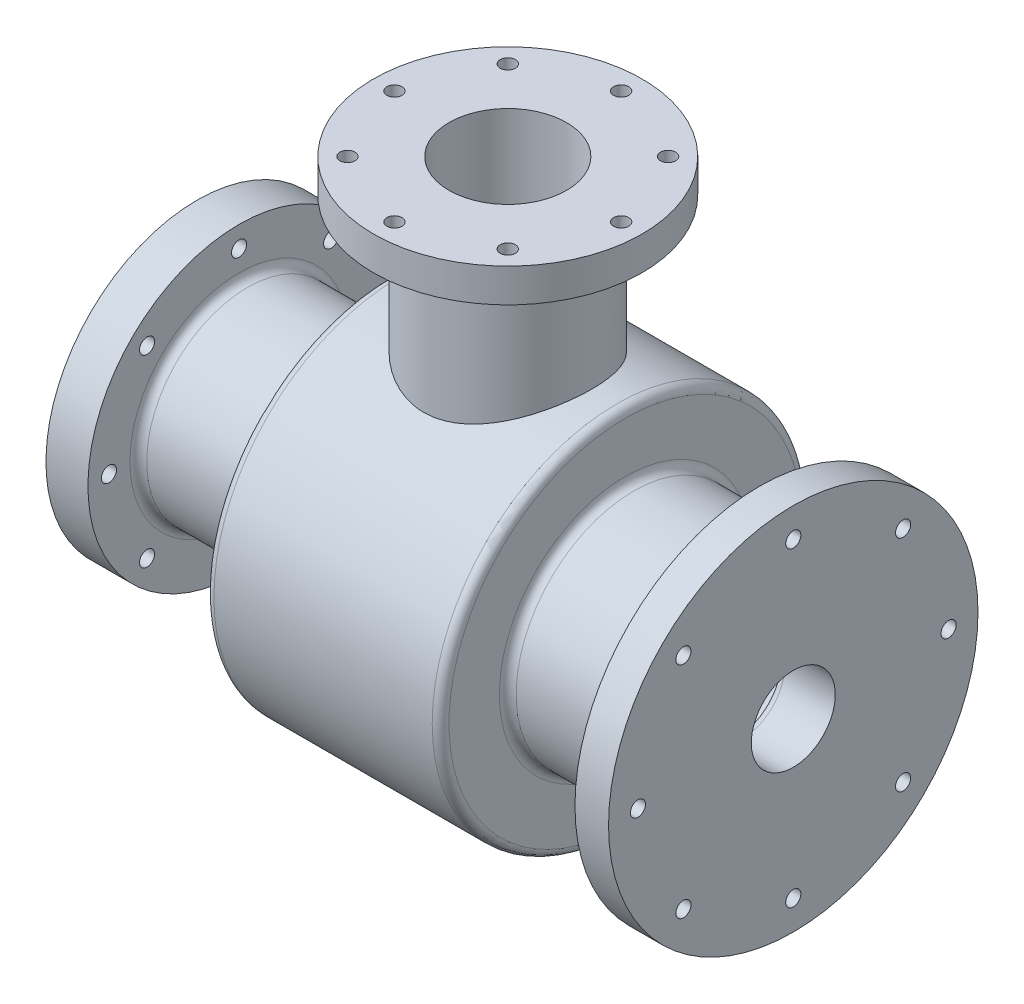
ISO-10303-21;
HEADER;
FILE_DESCRIPTION(('STEP AP214'),'2;1');
FILE_NAME('part.step','',(''),(''),'','','');
FILE_SCHEMA(('AUTOMOTIVE_DESIGN { 1 0 10303 214 1 1 1 1 }'));
ENDSEC;
DATA;
#1=APPLICATION_CONTEXT('core data for automotive mechanical design processes');
#2=APPLICATION_PROTOCOL_DEFINITION('international standard','automotive_design',2000,#1);
#3=PRODUCT_CONTEXT('',#1,'mechanical');
#4=PRODUCT('Part','Part','',(#3));
#5=PRODUCT_RELATED_PRODUCT_CATEGORY('part','',(#4));
#6=PRODUCT_DEFINITION_FORMATION('','',#4);
#7=PRODUCT_DEFINITION_CONTEXT('part definition',#1,'design');
#8=PRODUCT_DEFINITION('design','',#6,#7);
#9=PRODUCT_DEFINITION_SHAPE('','',#8);
#10=(LENGTH_UNIT() NAMED_UNIT(*) SI_UNIT(.MILLI.,.METRE.));
#11=(NAMED_UNIT(*) PLANE_ANGLE_UNIT() SI_UNIT($,.RADIAN.));
#12=(NAMED_UNIT(*) SI_UNIT($,.STERADIAN.) SOLID_ANGLE_UNIT());
#13=UNCERTAINTY_MEASURE_WITH_UNIT(LENGTH_MEASURE(1.E-05),#10,'distance_accuracy_value','');
#14=(GEOMETRIC_REPRESENTATION_CONTEXT(3) GLOBAL_UNCERTAINTY_ASSIGNED_CONTEXT((#13)) GLOBAL_UNIT_ASSIGNED_CONTEXT((#10,
#11,#12)) REPRESENTATION_CONTEXT('',''));
#15=CARTESIAN_POINT('',(0.,0.,0.));
#16=DIRECTION('',(0.,0.,1.));
#17=DIRECTION('',(1.,0.,0.));
#18=AXIS2_PLACEMENT_3D('',#15,#16,#17);
#19=CARTESIAN_POINT('',(-185.,-90.,0.));
#20=DIRECTION('',(1.,0.,0.));
#21=DIRECTION('',(0.,1.,0.));
#22=AXIS2_PLACEMENT_3D('',#19,#20,#21);
#23=PLANE('',#22);
#24=CARTESIAN_POINT('',(-185.,54.8007755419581,-54.8007755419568));
#25=DIRECTION('',(-1.,0.,0.));
#26=DIRECTION('',(0.,0.,1.));
#27=AXIS2_PLACEMENT_3D('',#24,#25,#26);
#28=CIRCLE('',#27,4.49999999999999);
#29=CARTESIAN_POINT('',(-185.,54.8007755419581,-50.3007755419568));
#30=VERTEX_POINT('',#29);
#31=EDGE_CURVE('E70',#30,#30,#28,.T.);
#32=ORIENTED_EDGE('',*,*,#31,.F.);
#33=EDGE_LOOP('',(#32));
#34=FACE_BOUND('',#33,.T.);
#35=CARTESIAN_POINT('',(-185.,7.89113445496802E-13,-77.5));
#36=DIRECTION('',(-1.,0.,0.));
#37=DIRECTION('',(0.,0.,1.));
#38=AXIS2_PLACEMENT_3D('',#35,#36,#37);
#39=CIRCLE('',#38,4.49999999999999);
#40=CARTESIAN_POINT('',(-185.,7.89113445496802E-13,-73.));
#41=VERTEX_POINT('',#40);
#42=EDGE_CURVE('E66',#41,#41,#39,.T.);
#43=ORIENTED_EDGE('',*,*,#42,.F.);
#44=EDGE_LOOP('',(#43));
#45=FACE_BOUND('',#44,.T.);
#46=CARTESIAN_POINT('',(-185.,-54.800775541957,-54.8007755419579));
#47=DIRECTION('',(-1.,0.,0.));
#48=DIRECTION('',(0.,0.,1.));
#49=AXIS2_PLACEMENT_3D('',#46,#47,#48);
#50=CIRCLE('',#49,4.49999999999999);
#51=CARTESIAN_POINT('',(-185.,-54.800775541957,-50.3007755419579));
#52=VERTEX_POINT('',#51);
#53=EDGE_CURVE('E62',#52,#52,#50,.T.);
#54=ORIENTED_EDGE('',*,*,#53,.F.);
#55=EDGE_LOOP('',(#54));
#56=FACE_BOUND('',#55,.T.);
#57=CARTESIAN_POINT('',(-185.,-77.5,0.));
#58=DIRECTION('',(-1.,0.,0.));
#59=DIRECTION('',(0.,0.,1.));
#60=AXIS2_PLACEMENT_3D('',#57,#58,#59);
#61=CIRCLE('',#60,4.49999999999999);
#62=CARTESIAN_POINT('',(-185.,-77.5,4.49999999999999));
#63=VERTEX_POINT('',#62);
#64=EDGE_CURVE('E61',#63,#63,#61,.T.);
#65=ORIENTED_EDGE('',*,*,#64,.F.);
#66=EDGE_LOOP('',(#65));
#67=FACE_BOUND('',#66,.T.);
#68=CARTESIAN_POINT('',(-185.,-54.8007755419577,54.8007755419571));
#69=DIRECTION('',(-1.,0.,0.));
#70=DIRECTION('',(0.,0.,1.));
#71=AXIS2_PLACEMENT_3D('',#68,#69,#70);
#72=CIRCLE('',#71,4.49999999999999);
#73=CARTESIAN_POINT('',(-185.,-54.8007755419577,59.3007755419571));
#74=VERTEX_POINT('',#73);
#75=EDGE_CURVE('E179',#74,#74,#72,.T.);
#76=ORIENTED_EDGE('',*,*,#75,.F.);
#77=EDGE_LOOP('',(#76));
#78=FACE_BOUND('',#77,.T.);
#79=CARTESIAN_POINT('',(-185.,-2.93245769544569E-13,77.5));
#80=DIRECTION('',(-1.,0.,0.));
#81=DIRECTION('',(0.,0.,1.));
#82=AXIS2_PLACEMENT_3D('',#79,#80,#81);
#83=CIRCLE('',#82,4.49999999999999);
#84=CARTESIAN_POINT('',(-185.,-2.93245769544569E-13,82.));
#85=VERTEX_POINT('',#84);
#86=EDGE_CURVE('E185',#85,#85,#83,.T.);
#87=ORIENTED_EDGE('',*,*,#86,.F.);
#88=EDGE_LOOP('',(#87));
#89=FACE_BOUND('',#88,.T.);
#90=CARTESIAN_POINT('',(-185.,54.8007755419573,54.8007755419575));
#91=DIRECTION('',(-1.,0.,0.));
#92=DIRECTION('',(0.,0.,1.));
#93=AXIS2_PLACEMENT_3D('',#90,#91,#92);
#94=CIRCLE('',#93,4.49999999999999);
#95=CARTESIAN_POINT('',(-185.,54.8007755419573,59.3007755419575));
#96=VERTEX_POINT('',#95);
#97=EDGE_CURVE('E57',#96,#96,#94,.T.);
#98=ORIENTED_EDGE('',*,*,#97,.F.);
#99=EDGE_LOOP('',(#98));
#100=FACE_BOUND('',#99,.T.);
#101=CARTESIAN_POINT('',(-185.,0.,0.));
#102=DIRECTION('',(1.,0.,0.));
#103=DIRECTION('',(0.,1.,0.));
#104=AXIS2_PLACEMENT_3D('',#101,#102,#103);
#105=CIRCLE('',#104,90.);
#106=CARTESIAN_POINT('',(-185.,90.,0.));
#107=VERTEX_POINT('',#106);
#108=EDGE_CURVE('E531',#107,#107,#105,.T.);
#109=ORIENTED_EDGE('',*,*,#108,.F.);
#110=EDGE_LOOP('',(#109));
#111=FACE_BOUND('',#110,.T.);
#112=CARTESIAN_POINT('',(-185.,0.,0.));
#113=DIRECTION('',(1.,0.,0.));
#114=DIRECTION('',(0.,1.,0.));
#115=AXIS2_PLACEMENT_3D('',#112,#113,#114);
#116=CIRCLE('',#115,40.);
#117=CARTESIAN_POINT('',(-185.,40.,0.));
#118=VERTEX_POINT('',#117);
#119=EDGE_CURVE('E504',#118,#118,#116,.T.);
#120=ORIENTED_EDGE('',*,*,#119,.T.);
#121=EDGE_LOOP('',(#120));
#122=FACE_BOUND('',#121,.T.);
#123=CARTESIAN_POINT('',(-185.,77.5,0.));
#124=DIRECTION('',(-1.,0.,0.));
#125=DIRECTION('',(0.,0.,1.));
#126=AXIS2_PLACEMENT_3D('',#123,#124,#125);
#127=CIRCLE('',#126,4.49999999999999);
#128=CARTESIAN_POINT('',(-185.,77.5,4.49999999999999));
#129=VERTEX_POINT('',#128);
#130=EDGE_CURVE('E53',#129,#129,#127,.T.);
#131=ORIENTED_EDGE('',*,*,#130,.F.);
#132=EDGE_LOOP('',(#131));
#133=FACE_BOUND('',#132,.T.);
#134=ADVANCED_FACE('F32',(#34,#45,#56,#67,#78,#89,#100,#111,#122,#133),#23,.F.);
#135=CARTESIAN_POINT('',(0.,-110.001,0.));
#136=DIRECTION('',(0.,1.,0.));
#137=DIRECTION('',(0.,0.,1.));
#138=AXIS2_PLACEMENT_3D('',#135,#136,#137);
#139=CYLINDRICAL_SURFACE('',#138,50.);
#140=CARTESIAN_POINT('',(0.,180.,0.));
#141=DIRECTION('',(0.,1.,0.));
#142=DIRECTION('',(0.,0.,1.));
#143=AXIS2_PLACEMENT_3D('',#140,#141,#142);
#144=CIRCLE('',#143,50.);
#145=CARTESIAN_POINT('',(0.,180.,50.));
#146=VERTEX_POINT('',#145);
#147=EDGE_CURVE('E449',#146,#146,#144,.F.);
#148=ORIENTED_EDGE('',*,*,#147,.T.);
#149=EDGE_LOOP('',(#148));
#150=FACE_BOUND('',#149,.T.);
#151=CARTESIAN_POINT('',(0.,97.9795897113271,50.));
#152=CARTESIAN_POINT('',(0.660484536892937,97.9795900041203,49.9999995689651));
#153=CARTESIAN_POINT('',(1.32096646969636,97.9862754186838,49.9869069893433));
#154=CARTESIAN_POINT('',(2.64064272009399,98.0129448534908,49.9345904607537));
#155=CARTESIAN_POINT('',(3.29983691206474,98.0329301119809,49.8953640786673));
#156=CARTESIAN_POINT('',(5.27415507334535,98.1126362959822,49.7385739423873));
#157=CARTESIAN_POINT('',(6.58564378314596,98.1921074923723,49.5818992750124));
#158=CARTESIAN_POINT('',(9.1908650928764,98.4011228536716,49.1657679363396));
#159=CARTESIAN_POINT('',(10.4845527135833,98.5307758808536,48.9060877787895));
#160=CARTESIAN_POINT('',(13.0421085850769,98.8356442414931,48.2869994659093));
#161=CARTESIAN_POINT('',(14.3059806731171,99.0108536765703,47.927604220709));
#162=CARTESIAN_POINT('',(16.7903169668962,99.4002843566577,47.1145985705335));
#163=CARTESIAN_POINT('',(18.0109548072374,99.6143215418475,46.6614313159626));
#164=CARTESIAN_POINT('',(19.8083457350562,99.9601133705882,45.9135158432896));
#165=CARTESIAN_POINT('',(20.4019188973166,100.079508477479,45.6528309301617));
#166=CARTESIAN_POINT('',(21.57735087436,100.325728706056,45.1091705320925));
#167=CARTESIAN_POINT('',(22.1592073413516,100.452555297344,44.8261906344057));
#168=CARTESIAN_POINT('',(23.8854598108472,100.842745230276,43.9448922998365));
#169=CARTESIAN_POINT('',(25.0111760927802,101.115942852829,43.3139496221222));
#170=CARTESIAN_POINT('',(27.20711256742,101.681368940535,41.9694035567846));
#171=CARTESIAN_POINT('',(28.2773288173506,101.973598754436,41.2557943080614));
#172=CARTESIAN_POINT('',(29.8725271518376,102.430878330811,40.1011479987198));
#173=CARTESIAN_POINT('',(30.4191613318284,102.591727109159,39.6880769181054));
#174=CARTESIAN_POINT('',(31.494457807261,102.915684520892,38.8402858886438));
#175=CARTESIAN_POINT('',(32.0231241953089,103.078792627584,38.4055709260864));
#176=CARTESIAN_POINT('',(33.5814800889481,103.569994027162,37.0696143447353));
#177=CARTESIAN_POINT('',(34.5835792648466,103.899979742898,36.1365226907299));
#178=CARTESIAN_POINT('',(36.5087696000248,104.556543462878,34.19041335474));
#179=CARTESIAN_POINT('',(37.4318281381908,104.883120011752,33.1773630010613));
#180=CARTESIAN_POINT('',(39.1933662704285,105.524627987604,31.0766608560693));
#181=CARTESIAN_POINT('',(40.0318439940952,105.839559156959,29.9890074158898));
#182=CARTESIAN_POINT('',(41.6612495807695,106.46625795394,27.6845900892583));
#183=CARTESIAN_POINT('',(42.4472349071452,106.776955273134,26.4640320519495));
#184=CARTESIAN_POINT('',(43.9128789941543,107.368017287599,23.95353162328));
#185=CARTESIAN_POINT('',(44.5925328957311,107.64838059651,22.663586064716));
#186=CARTESIAN_POINT('',(45.8388220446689,108.170594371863,20.0232976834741));
#187=CARTESIAN_POINT('',(46.4055031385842,108.41246045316,18.6729796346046));
#188=CARTESIAN_POINT('',(47.420066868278,108.850600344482,15.9212744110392));
#189=CARTESIAN_POINT('',(47.8679596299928,109.046878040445,14.519891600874));
#190=CARTESIAN_POINT('',(48.6162436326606,109.377481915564,11.7633054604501));
#191=CARTESIAN_POINT('',(48.9239227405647,109.514839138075,10.4104422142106));
#192=CARTESIAN_POINT('',(49.4261816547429,109.740133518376,7.67980282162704));
#193=CARTESIAN_POINT('',(49.6207656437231,109.828072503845,6.30202759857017));
#194=CARTESIAN_POINT('',(49.8943910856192,109.951968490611,3.53329555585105));
#195=CARTESIAN_POINT('',(49.9734803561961,109.987947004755,2.14234443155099));
#196=CARTESIAN_POINT('',(50.0152584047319,110.006934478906,-0.641637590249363));
#197=CARTESIAN_POINT('',(49.9779527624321,109.989945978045,-2.03466838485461));
#198=CARTESIAN_POINT('',(49.7943408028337,109.906644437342,-4.71066246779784));
#199=CARTESIAN_POINT('',(49.6561082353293,109.84398545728,-5.99430346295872));
#200=CARTESIAN_POINT('',(49.2814094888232,109.675108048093,-8.54418293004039));
#201=CARTESIAN_POINT('',(49.0449489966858,109.568892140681,-9.81042240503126));
#202=CARTESIAN_POINT('',(48.4762117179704,109.315499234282,-12.3170088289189));
#203=CARTESIAN_POINT('',(48.1439317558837,109.168320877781,-13.5573549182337));
#204=CARTESIAN_POINT('',(47.3867404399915,108.836516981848,-16.0042869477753));
#205=CARTESIAN_POINT('',(46.9618260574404,108.651890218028,-17.210871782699));
#206=CARTESIAN_POINT('',(46.0160293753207,108.246430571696,-19.6010660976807));
#207=CARTESIAN_POINT('',(45.4937974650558,108.025094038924,-20.7840554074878));
#208=CARTESIAN_POINT('',(44.3620170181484,107.553354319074,-23.1013932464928));
#209=CARTESIAN_POINT('',(43.7524683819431,107.302951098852,-24.2357417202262));
#210=CARTESIAN_POINT('',(42.4502837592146,106.778609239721,-26.4504055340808));
#211=CARTESIAN_POINT('',(41.7576244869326,106.504664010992,-27.5307056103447));
#212=CARTESIAN_POINT('',(40.2938194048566,105.939303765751,-29.631874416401));
#213=CARTESIAN_POINT('',(39.5226696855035,105.647887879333,-30.6527401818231));
#214=CARTESIAN_POINT('',(37.8401476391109,105.029594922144,-32.7113290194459));
#215=CARTESIAN_POINT('',(36.9224682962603,104.701764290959,-33.7436343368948));
#216=CARTESIAN_POINT('',(35.4852505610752,104.206529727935,-35.2317027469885));
#217=CARTESIAN_POINT('',(34.9960271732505,104.040859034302,-35.7176907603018));
#218=CARTESIAN_POINT('',(33.9978046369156,103.709348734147,-36.6691255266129));
#219=CARTESIAN_POINT('',(33.4888007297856,103.543509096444,-37.1345672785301));
#220=CARTESIAN_POINT('',(31.9329122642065,103.047290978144,-38.4992576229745));
#221=CARTESIAN_POINT('',(30.85735762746,102.718285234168,-39.3666573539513));
#222=CARTESIAN_POINT('',(28.6356573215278,102.072873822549,-41.0110831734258));
#223=CARTESIAN_POINT('',(27.4895129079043,101.75646793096,-41.7881108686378));
#224=CARTESIAN_POINT('',(25.6952016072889,101.291111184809,-42.8985046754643));
#225=CARTESIAN_POINT('',(25.0703600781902,101.134293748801,-43.2666612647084));
#226=CARTESIAN_POINT('',(23.8040193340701,100.827843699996,-43.9760750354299));
#227=CARTESIAN_POINT('',(23.1625240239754,100.678209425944,-44.3173384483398));
#228=CARTESIAN_POINT('',(21.8636328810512,100.387339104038,-44.9723316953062));
#229=CARTESIAN_POINT('',(21.2062347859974,100.246104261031,-45.2860575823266));
#230=CARTESIAN_POINT('',(19.8766961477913,99.9732934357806,-45.8851702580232));
#231=CARTESIAN_POINT('',(19.2045547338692,99.8417180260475,-46.1705553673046));
#232=CARTESIAN_POINT('',(17.1686947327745,99.4635049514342,-46.9826405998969));
#233=CARTESIAN_POINT('',(15.7842452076,99.2330865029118,-47.4659245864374));
#234=CARTESIAN_POINT('',(12.9713240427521,98.8246898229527,-48.3104672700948));
#235=CARTESIAN_POINT('',(11.5428572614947,98.6467058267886,-48.6717393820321));
#236=CARTESIAN_POINT('',(8.75853579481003,98.3612525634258,-49.245904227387));
#237=CARTESIAN_POINT('',(7.40494064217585,98.2496013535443,-49.4676665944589));
#238=CARTESIAN_POINT('',(4.68069961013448,98.0819108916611,-49.7993334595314));
#239=CARTESIAN_POINT('',(3.31005458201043,98.0258688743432,-49.9092435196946));
#240=CARTESIAN_POINT('',(0.563781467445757,97.9715969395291,-50.0156952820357));
#241=CARTESIAN_POINT('',(-0.811844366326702,97.973343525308,-50.0122830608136));
#242=CARTESIAN_POINT('',(-3.55681314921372,98.0345266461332,-49.8922455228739));
#243=CARTESIAN_POINT('',(-4.92615636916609,98.0939606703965,-49.7756251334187));
#244=CARTESIAN_POINT('',(-7.53455520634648,98.2609652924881,-49.4450552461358));
#245=CARTESIAN_POINT('',(-8.77502694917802,98.3641525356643,-49.2399443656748));
#246=CARTESIAN_POINT('',(-11.2327411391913,98.6137923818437,-48.7380593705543));
#247=CARTESIAN_POINT('',(-12.4499851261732,98.7602421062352,-48.4412913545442));
#248=CARTESIAN_POINT('',(-14.8540851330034,99.0920064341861,-47.7589568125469));
#249=CARTESIAN_POINT('',(-16.0409352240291,99.2773285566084,-47.3733731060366));
#250=CARTESIAN_POINT('',(-18.3775180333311,99.6815363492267,-46.5168291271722));
#251=CARTESIAN_POINT('',(-19.5272487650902,99.9004238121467,-46.045864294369));
#252=CARTESIAN_POINT('',(-21.8350490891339,100.376477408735,-44.9989789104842));
#253=CARTESIAN_POINT('',(-22.9911329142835,100.634929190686,-44.4192676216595));
#254=CARTESIAN_POINT('',(-25.2508168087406,101.175094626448,-43.1747634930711));
#255=CARTESIAN_POINT('',(-26.3544159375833,101.456808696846,-42.5099691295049));
#256=CARTESIAN_POINT('',(-28.5045723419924,102.036455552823,-41.0991894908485));
#257=CARTESIAN_POINT('',(-29.5511067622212,102.334394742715,-40.3531720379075));
#258=CARTESIAN_POINT('',(-31.5821150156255,102.939253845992,-38.7842350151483));
#259=CARTESIAN_POINT('',(-32.5665855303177,103.24617423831,-37.9613113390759));
#260=CARTESIAN_POINT('',(-34.5646088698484,103.892883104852,-36.1562928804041));
#261=CARTESIAN_POINT('',(-35.5711660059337,104.232879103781,-35.1665122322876));
#262=CARTESIAN_POINT('',(-37.4981155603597,104.906117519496,-33.1041263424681));
#263=CARTESIAN_POINT('',(-38.4185024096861,105.239359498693,-32.0315157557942));
#264=CARTESIAN_POINT('',(-40.1674257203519,105.89033547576,-29.8090203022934));
#265=CARTESIAN_POINT('',(-40.9959439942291,106.208066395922,-28.6591202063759));
#266=CARTESIAN_POINT('',(-42.554929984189,106.819510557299,-26.2885954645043));
#267=CARTESIAN_POINT('',(-43.285399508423,107.113224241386,-25.0679721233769));
#268=CARTESIAN_POINT('',(-44.6499342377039,107.67183778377,-22.5490136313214));
#269=CARTESIAN_POINT('',(-45.2828184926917,107.936375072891,-21.2499569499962));
#270=CARTESIAN_POINT('',(-46.4360316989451,108.425237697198,-18.5954006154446));
#271=CARTESIAN_POINT('',(-46.9563584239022,108.649562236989,-17.2398998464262));
#272=CARTESIAN_POINT('',(-47.878460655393,109.05124830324,-14.4832319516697));
#273=CARTESIAN_POINT('',(-48.2803060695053,109.228637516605,-13.082092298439));
#274=CARTESIAN_POINT('',(-48.9609355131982,109.531182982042,-10.2447363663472));
#275=CARTESIAN_POINT('',(-49.2397310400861,109.656344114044,-8.8085233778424));
#276=CARTESIAN_POINT('',(-49.6533240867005,109.842712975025,-6.02985264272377));
#277=CARTESIAN_POINT('',(-49.7978899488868,109.908250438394,-4.68913132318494));
#278=CARTESIAN_POINT('',(-49.9782093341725,109.990066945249,-1.99891860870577));
#279=CARTESIAN_POINT('',(-50.0139689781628,110.006348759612,-0.649427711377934));
#280=CARTESIAN_POINT('',(-49.9762587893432,109.989209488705,2.04740876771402));
#281=CARTESIAN_POINT('',(-49.9028119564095,109.955798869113,3.39475474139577));
#282=CARTESIAN_POINT('',(-49.6476054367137,109.840210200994,6.07701367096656));
#283=CARTESIAN_POINT('',(-49.4658472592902,109.758032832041,7.41192679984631));
#284=CARTESIAN_POINT('',(-49.0074212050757,109.552214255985,9.9955294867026));
#285=CARTESIAN_POINT('',(-48.735729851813,109.430753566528,11.24528135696));
#286=CARTESIAN_POINT('',(-48.0988161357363,109.148589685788,13.7161028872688));
#287=CARTESIAN_POINT('',(-47.7335977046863,108.987888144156,14.9371737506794));
#288=CARTESIAN_POINT('',(-46.9129409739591,108.630969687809,17.3433577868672));
#289=CARTESIAN_POINT('',(-46.4574932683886,108.434749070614,18.5284671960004));
#290=CARTESIAN_POINT('',(-45.4602071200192,108.011234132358,20.8560012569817));
#291=CARTESIAN_POINT('',(-44.9183648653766,107.783938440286,21.9984240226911));
#292=CARTESIAN_POINT('',(-43.7257082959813,107.292259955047,24.2858239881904));
#293=CARTESIAN_POINT('',(-43.071045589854,107.026656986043,25.4285319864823));
#294=CARTESIAN_POINT('',(-41.6764854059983,106.473094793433,27.6549493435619));
#295=CARTESIAN_POINT('',(-40.9365860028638,106.185135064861,28.7386573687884));
#296=CARTESIAN_POINT('',(-39.3760183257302,105.593320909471,30.8422589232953));
#297=CARTESIAN_POINT('',(-38.55532113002,105.289460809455,31.8621293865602));
#298=CARTESIAN_POINT('',(-36.8380246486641,104.672813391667,33.8329496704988));
#299=CARTESIAN_POINT('',(-35.9414220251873,104.360025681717,34.7838964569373));
#300=CARTESIAN_POINT('',(-33.9996764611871,103.706675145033,36.688156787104));
#301=CARTESIAN_POINT('',(-32.9483813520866,103.365955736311,37.6351546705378));
#302=CARTESIAN_POINT('',(-30.7679005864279,102.691717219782,39.4377680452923));
#303=CARTESIAN_POINT('',(-29.6387096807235,102.358198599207,40.2933773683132));
#304=CARTESIAN_POINT('',(-27.3076131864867,101.707682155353,41.9083033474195));
#305=CARTESIAN_POINT('',(-26.105656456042,101.390696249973,42.6675510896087));
#306=CARTESIAN_POINT('',(-23.6364412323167,100.783180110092,44.0833781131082));
#307=CARTESIAN_POINT('',(-22.3691864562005,100.492648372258,44.7399632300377));
#308=CARTESIAN_POINT('',(-19.7660152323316,99.9453099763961,45.9497544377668));
#309=CARTESIAN_POINT('',(-18.4296292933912,99.6887927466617,46.5020884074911));
#310=CARTESIAN_POINT('',(-16.3878318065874,99.3383623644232,47.2436683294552));
#311=CARTESIAN_POINT('',(-15.7008533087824,99.2272530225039,47.4764220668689));
#312=CARTESIAN_POINT('',(-14.3157048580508,99.0175294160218,47.9122891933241));
#313=CARTESIAN_POINT('',(-13.6175362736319,98.9189136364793,48.1154061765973));
#314=CARTESIAN_POINT('',(-12.2133516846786,98.7354178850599,48.4908318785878));
#315=CARTESIAN_POINT('',(-11.5073636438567,98.6504996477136,48.663226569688));
#316=CARTESIAN_POINT('',(-10.0871206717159,98.4949333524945,48.9773297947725));
#317=CARTESIAN_POINT('',(-9.37286678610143,98.424283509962,49.1190421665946));
#318=CARTESIAN_POINT('',(-7.93799367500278,98.2980230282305,49.3712320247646));
#319=CARTESIAN_POINT('',(-7.21737857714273,98.2424032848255,49.4817284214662));
#320=CARTESIAN_POINT('',(-5.77107160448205,98.1467507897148,49.6711846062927));
#321=CARTESIAN_POINT('',(-5.04538036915,98.1067161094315,49.7501482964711));
#322=CARTESIAN_POINT('',(-3.60056382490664,98.0431048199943,49.8753893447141));
#323=CARTESIAN_POINT('',(-2.88148592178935,98.0193089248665,49.922102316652));
#324=CARTESIAN_POINT('',(-1.44160435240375,97.9875509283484,49.9844084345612));
#325=CARTESIAN_POINT('',(-0.720800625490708,97.9795893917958,50.0000004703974));
#326=CARTESIAN_POINT('',(0.,97.9795897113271,50.));
#327=B_SPLINE_CURVE_WITH_KNOTS('',3,(#151,#152,#153,#154,#155,#156,#157,#158,#159,#160,#161,
#162,#163,#164,#165,#166,#167,#168,#169,#170,#171,#172,#173,#174,#175,#176,#177,#178,#179,#180,
#181,#182,#183,#184,#185,#186,#187,#188,#189,#190,#191,#192,#193,#194,#195,#196,#197,#198,#199,
#200,#201,#202,#203,#204,#205,#206,#207,#208,#209,#210,#211,#212,#213,#214,#215,#216,#217,#218,
#219,#220,#221,#222,#223,#224,#225,#226,#227,#228,#229,#230,#231,#232,#233,#234,#235,#236,#237,
#238,#239,#240,#241,#242,#243,#244,#245,#246,#247,#248,#249,#250,#251,#252,#253,#254,#255,#256,
#257,#258,#259,#260,#261,#262,#263,#264,#265,#266,#267,#268,#269,#270,#271,#272,#273,#274,#275,
#276,#277,#278,#279,#280,#281,#282,#283,#284,#285,#286,#287,#288,#289,#290,#291,#292,#293,#294,
#295,#296,#297,#298,#299,#300,#301,#302,#303,#304,#305,#306,#307,#308,#309,#310,#311,#312,#313,
#314,#315,#316,#317,#318,#319,#320,#321,#322,#323,#324,#325,#326),.UNSPECIFIED.,.T.,.F.,(4,2,2,
2,2,2,2,2,2,2,2,2,2,2,2,2,2,2,2,2,2,2,2,2,2,2,2,2,2,2,2,2,2,2,2,2,2,2,2,2,2,2,2,2,2,2,2,2,2,2,2,
2,2,2,2,2,2,2,2,2,2,2,2,2,2,2,2,2,2,2,2,2,2,2,2,2,2,2,2,2,2,2,2,2,2,2,2,4),(0.,1.98126386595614,
3.96271221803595,7.92671752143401,11.8993708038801,15.8715099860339,19.8252895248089,
21.8024340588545,23.7799709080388,27.7329463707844,31.6862022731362,33.7970386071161,
35.9073908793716,40.1278945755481,44.3501318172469,48.5724624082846,53.0206472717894,
57.4690353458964,61.9156144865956,66.3618144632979,70.5388561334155,74.715743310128,
78.8909006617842,83.0658578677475,86.9390388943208,90.8119957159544,94.6850809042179,
98.5582927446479,102.489868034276,106.421447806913,110.354131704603,114.287011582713,
118.540704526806,120.667832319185,122.795475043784,127.051675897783,131.307801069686,
133.533186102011,135.758053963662,137.983240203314,140.208558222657,144.654769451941,
149.100491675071,153.22338636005,157.346076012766,161.467089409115,165.587923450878,
169.368250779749,173.148326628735,176.929134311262,180.710143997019,184.66259773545,
188.615122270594,192.5692184,196.523525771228,200.874656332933,205.226067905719,209.57833940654,
213.930530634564,218.331836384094,222.733229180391,227.132019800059,231.530399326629,
235.575455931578,239.62028497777,243.664262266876,247.708183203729,251.557920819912,
255.407496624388,259.257473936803,263.107621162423,267.133720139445,271.159910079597,
275.187546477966,279.215360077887,283.576471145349,287.937876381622,292.302383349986,
296.666642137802,301.065932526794,303.266677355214,305.467155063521,307.661374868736,
309.855320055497,312.047933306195,314.240275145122,316.402392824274,318.564587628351),.UNSPECIFIED.);
#328=CARTESIAN_POINT('',(0.,97.9795897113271,50.));
#329=VERTEX_POINT('',#328);
#330=EDGE_CURVE('E534',#329,#329,#327,.T.);
#331=ORIENTED_EDGE('',*,*,#330,.T.);
#332=EDGE_LOOP('',(#331));
#333=FACE_BOUND('',#332,.T.);
#334=ADVANCED_FACE('F392',(#150,#333),#139,.T.);
#335=CARTESIAN_POINT('',(0.,0.,0.));
#336=DIRECTION('',(1.,0.,0.));
#337=DIRECTION('',(0.,1.,0.));
#338=AXIS2_PLACEMENT_3D('',#335,#336,#337);
#339=CYLINDRICAL_SURFACE('',#338,40.);
#340=CARTESIAN_POINT('',(-150.,0.,0.));
#341=DIRECTION('',(-1.,0.,0.));
#342=DIRECTION('',(0.,-1.,0.));
#343=AXIS2_PLACEMENT_3D('',#340,#341,#342);
#344=CIRCLE('',#343,40.);
#345=CARTESIAN_POINT('',(-150.,-40.,0.));
#346=VERTEX_POINT('',#345);
#347=EDGE_CURVE('E451',#346,#346,#344,.F.);
#348=ORIENTED_EDGE('',*,*,#347,.T.);
#349=EDGE_LOOP('',(#348));
#350=FACE_BOUND('',#349,.T.);
#351=ORIENTED_EDGE('',*,*,#119,.F.);
#352=EDGE_LOOP('',(#351));
#353=FACE_BOUND('',#352,.T.);
#354=ADVANCED_FACE('F388',(#350,#353),#339,.F.);
#355=CARTESIAN_POINT('',(0.,0.,0.));
#356=DIRECTION('',(1.,0.,0.));
#357=DIRECTION('',(0.,1.,0.));
#358=AXIS2_PLACEMENT_3D('',#355,#356,#357);
#359=CYLINDRICAL_SURFACE('',#358,45.);
#360=CARTESIAN_POINT('',(-145.,0.,0.));
#361=DIRECTION('',(1.,0.,0.));
#362=DIRECTION('',(0.,1.,0.));
#363=AXIS2_PLACEMENT_3D('',#360,#361,#362);
#364=CIRCLE('',#363,45.);
#365=CARTESIAN_POINT('',(-145.,45.,0.));
#366=VERTEX_POINT('',#365);
#367=EDGE_CURVE('E507',#366,#366,#364,.T.);
#368=ORIENTED_EDGE('',*,*,#367,.F.);
#369=EDGE_LOOP('',(#368));
#370=FACE_BOUND('',#369,.T.);
#371=CARTESIAN_POINT('',(-55.,0.,0.));
#372=DIRECTION('',(1.,0.,0.));
#373=DIRECTION('',(0.,1.,0.));
#374=AXIS2_PLACEMENT_3D('',#371,#372,#373);
#375=CIRCLE('',#374,45.);
#376=CARTESIAN_POINT('',(-55.,45.,0.));
#377=VERTEX_POINT('',#376);
#378=EDGE_CURVE('E510',#377,#377,#375,.T.);
#379=ORIENTED_EDGE('',*,*,#378,.T.);
#380=EDGE_LOOP('',(#379));
#381=FACE_BOUND('',#380,.T.);
#382=ADVANCED_FACE('F384',(#370,#381),#359,.F.);
#383=CARTESIAN_POINT('',(-55.,-45.,0.));
#384=DIRECTION('',(-1.,0.,0.));
#385=DIRECTION('',(0.,-1.,0.));
#386=AXIS2_PLACEMENT_3D('',#383,#384,#385);
#387=PLANE('',#386);
#388=CARTESIAN_POINT('',(-55.,0.,0.));
#389=DIRECTION('',(-1.,0.,0.));
#390=DIRECTION('',(0.,-1.,0.));
#391=AXIS2_PLACEMENT_3D('',#388,#389,#390);
#392=CIRCLE('',#391,90.);
#393=CARTESIAN_POINT('',(-55.,-90.,0.));
#394=VERTEX_POINT('',#393);
#395=EDGE_CURVE('E454',#394,#394,#392,.F.);
#396=ORIENTED_EDGE('',*,*,#395,.T.);
#397=EDGE_LOOP('',(#396));
#398=FACE_BOUND('',#397,.T.);
#399=ORIENTED_EDGE('',*,*,#378,.F.);
#400=EDGE_LOOP('',(#399));
#401=FACE_BOUND('',#400,.T.);
#402=ADVANCED_FACE('F380',(#398,#401),#387,.F.);
#403=CARTESIAN_POINT('',(0.,0.,0.));
#404=DIRECTION('',(1.,0.,0.));
#405=DIRECTION('',(0.,1.,0.));
#406=AXIS2_PLACEMENT_3D('',#403,#404,#405);
#407=CYLINDRICAL_SURFACE('',#406,95.);
#408=CARTESIAN_POINT('',(15.,0.,-95.));
#409=CARTESIAN_POINT('',(15.0000060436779,0.418632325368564,-95.0000025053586));
#410=CARTESIAN_POINT('',(14.9824690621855,0.837181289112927,-94.9972276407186));
#411=CARTESIAN_POINT('',(14.9124635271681,1.67140505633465,-94.9862110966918));
#412=CARTESIAN_POINT('',(14.8599878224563,2.08707925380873,-94.9779682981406));
#413=CARTESIAN_POINT('',(14.7204322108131,2.91279582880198,-94.9562341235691));
#414=CARTESIAN_POINT('',(14.6333223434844,3.32283301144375,-94.9427382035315));
#415=CARTESIAN_POINT('',(14.4251676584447,4.13398660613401,-94.9108786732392));
#416=CARTESIAN_POINT('',(14.3041245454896,4.53510346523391,-94.8925153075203));
#417=CARTESIAN_POINT('',(14.0291133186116,5.32530384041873,-94.8514499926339));
#418=CARTESIAN_POINT('',(13.8751708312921,5.71439645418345,-94.8287514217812));
#419=CARTESIAN_POINT('',(13.5354324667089,6.47817615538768,-94.7796375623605));
#420=CARTESIAN_POINT('',(13.3496362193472,6.8528630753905,-94.7532222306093));
#421=CARTESIAN_POINT('',(12.9475569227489,7.58519887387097,-94.6974108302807));
#422=CARTESIAN_POINT('',(12.7312782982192,7.94285021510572,-94.6680151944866));
#423=CARTESIAN_POINT('',(12.2697395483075,8.63873917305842,-94.6070515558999));
#424=CARTESIAN_POINT('',(12.0244793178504,8.97697671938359,-94.5754835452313));
#425=CARTESIAN_POINT('',(11.504678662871,9.63427619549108,-94.51079642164));
#426=CARTESIAN_POINT('',(11.2299269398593,9.95317005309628,-94.4776672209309));
#427=CARTESIAN_POINT('',(10.6546278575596,10.5667291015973,-94.4110135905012));
#428=CARTESIAN_POINT('',(10.3540803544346,10.8613941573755,-94.3774891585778));
#429=CARTESIAN_POINT('',(9.72924181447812,11.4244796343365,-94.3109838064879));
#430=CARTESIAN_POINT('',(9.40494938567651,11.6928985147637,-94.278002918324));
#431=CARTESIAN_POINT('',(8.7348629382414,12.2016031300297,-94.2135162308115));
#432=CARTESIAN_POINT('',(8.38906888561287,12.441888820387,-94.1820104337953));
#433=CARTESIAN_POINT('',(7.67639849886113,12.8938717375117,-94.1212004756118));
#434=CARTESIAN_POINT('',(7.30941657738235,13.1054042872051,-94.0919093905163));
#435=CARTESIAN_POINT('',(6.55868429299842,13.4967719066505,-94.036568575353));
#436=CARTESIAN_POINT('',(6.17493385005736,13.6766068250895,-94.0105188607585));
#437=CARTESIAN_POINT('',(5.39339636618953,14.0032366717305,-93.9624213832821));
#438=CARTESIAN_POINT('',(4.99560998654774,14.1500331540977,-93.9403734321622));
#439=CARTESIAN_POINT('',(4.18883012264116,14.4094846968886,-93.9009264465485));
#440=CARTESIAN_POINT('',(3.77983674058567,14.5221400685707,-93.8835273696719));
#441=CARTESIAN_POINT('',(2.95702265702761,14.7116543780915,-93.8540161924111));
#442=CARTESIAN_POINT('',(2.54326995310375,14.7888019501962,-93.8418615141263));
#443=CARTESIAN_POINT('',(1.7106236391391,14.9080731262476,-93.8229876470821));
#444=CARTESIAN_POINT('',(1.29173005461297,14.9501969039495,-93.8162684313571));
#445=CARTESIAN_POINT('',(0.451855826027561,14.9990920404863,-93.808463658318));
#446=CARTESIAN_POINT('',(0.0308753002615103,15.0058653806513,-93.8073777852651));
#447=CARTESIAN_POINT('',(-0.810141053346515,14.9840119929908,-93.8108709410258));
#448=CARTESIAN_POINT('',(-1.23017688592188,14.9553854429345,-93.8154499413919));
#449=CARTESIAN_POINT('',(-2.06239727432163,14.8633833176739,-93.8300696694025));
#450=CARTESIAN_POINT('',(-2.47461851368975,14.8003310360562,-93.8400595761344));
#451=CARTESIAN_POINT('',(-3.29222905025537,14.6401762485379,-93.8651788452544));
#452=CARTESIAN_POINT('',(-3.69761839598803,14.5430739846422,-93.8803081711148));
#453=CARTESIAN_POINT('',(-4.49873295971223,14.3155438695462,-93.9152726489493));
#454=CARTESIAN_POINT('',(-4.89445796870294,14.1851152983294,-93.9351079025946));
#455=CARTESIAN_POINT('',(-5.67349252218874,13.8918934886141,-93.9789191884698));
#456=CARTESIAN_POINT('',(-6.05680198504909,13.7291000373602,-94.0028952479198));
#457=CARTESIAN_POINT('',(-6.81000339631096,13.3715516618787,-94.0544222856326));
#458=CARTESIAN_POINT('',(-7.17983008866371,13.176661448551,-94.0819882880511));
#459=CARTESIAN_POINT('',(-7.90177725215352,12.7568134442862,-94.1398353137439));
#460=CARTESIAN_POINT('',(-8.25389769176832,12.5318555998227,-94.1701163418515));
#461=CARTESIAN_POINT('',(-8.93806392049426,12.0534338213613,-94.2325469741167));
#462=CARTESIAN_POINT('',(-9.27010848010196,11.7999681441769,-94.264696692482));
#463=CARTESIAN_POINT('',(-9.91185639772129,11.2662891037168,-94.3299685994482));
#464=CARTESIAN_POINT('',(-10.2215595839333,10.9860755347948,-94.3630907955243));
#465=CARTESIAN_POINT('',(-10.819836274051,10.3975556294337,-94.429759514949));
#466=CARTESIAN_POINT('',(-11.10813672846,10.0889717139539,-94.4633066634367));
#467=CARTESIAN_POINT('',(-11.6577468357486,9.44854464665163,-94.5295118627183));
#468=CARTESIAN_POINT('',(-11.9190562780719,9.11670131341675,-94.5621699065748));
#469=CARTESIAN_POINT('',(-12.4128456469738,8.43204646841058,-94.6256770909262));
#470=CARTESIAN_POINT('',(-12.6453252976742,8.0792347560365,-94.6565262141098));
#471=CARTESIAN_POINT('',(-13.0797883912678,7.35509469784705,-94.7155453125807));
#472=CARTESIAN_POINT('',(-13.2817719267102,6.98376640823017,-94.7437152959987));
#473=CARTESIAN_POINT('',(-13.6539050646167,6.22491653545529,-94.7965988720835));
#474=CARTESIAN_POINT('',(-13.8240318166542,5.83738357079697,-94.821309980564));
#475=CARTESIAN_POINT('',(-14.1310066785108,5.04911369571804,-94.866549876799));
#476=CARTESIAN_POINT('',(-14.2678547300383,4.6483767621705,-94.8870786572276));
#477=CARTESIAN_POINT('',(-14.5072263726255,3.83659274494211,-94.9233670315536));
#478=CARTESIAN_POINT('',(-14.6097520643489,3.42554629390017,-94.9391269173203));
#479=CARTESIAN_POINT('',(-14.7796988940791,2.59609570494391,-94.9654276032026));
#480=CARTESIAN_POINT('',(-14.8471203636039,2.17769163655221,-94.9759684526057));
#481=CARTESIAN_POINT('',(-14.9458087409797,1.3410290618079,-94.9914461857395));
#482=CARTESIAN_POINT('',(-14.9774504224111,0.922815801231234,-94.9964411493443));
#483=CARTESIAN_POINT('',(-15.0056105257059,0.0851803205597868,-95.0008849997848));
#484=CARTESIAN_POINT('',(-15.0021291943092,-0.334241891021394,-95.0003339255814));
#485=CARTESIAN_POINT('',(-14.9600711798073,-1.17126425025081,-94.9937013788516));
#486=CARTESIAN_POINT('',(-14.9214956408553,-1.58886445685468,-94.9876200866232));
#487=CARTESIAN_POINT('',(-14.8095477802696,-2.41925942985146,-94.9700987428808));
#488=CARTESIAN_POINT('',(-14.7361754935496,-2.83205420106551,-94.9586586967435));
#489=CARTESIAN_POINT('',(-14.5556836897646,-3.64768272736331,-94.9308170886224));
#490=CARTESIAN_POINT('',(-14.4487485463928,-4.05055823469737,-94.9144426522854));
#491=CARTESIAN_POINT('',(-14.2018079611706,-4.84582371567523,-94.8771651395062));
#492=CARTESIAN_POINT('',(-14.0618026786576,-5.23821373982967,-94.8562620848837));
#493=CARTESIAN_POINT('',(-13.7497405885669,-6.00981102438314,-94.8105034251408));
#494=CARTESIAN_POINT('',(-13.5776825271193,-6.38901776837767,-94.7856476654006));
#495=CARTESIAN_POINT('',(-13.2027538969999,-7.13164142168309,-94.7326674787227));
#496=CARTESIAN_POINT('',(-12.9998830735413,-7.49505820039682,-94.7045430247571));
#497=CARTESIAN_POINT('',(-12.5630168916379,-8.20647536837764,-94.6455608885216));
#498=CARTESIAN_POINT('',(-12.3287855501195,-8.55432919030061,-94.6146831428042));
#499=CARTESIAN_POINT('',(-11.8321146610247,-9.2291153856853,-94.5512469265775));
#500=CARTESIAN_POINT('',(-11.5696749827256,-9.55604766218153,-94.5186884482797));
#501=CARTESIAN_POINT('',(-11.0183895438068,-10.1867824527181,-94.4527926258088));
#502=CARTESIAN_POINT('',(-10.729542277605,-10.4905836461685,-94.4194552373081));
#503=CARTESIAN_POINT('',(-10.1274334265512,-11.0729634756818,-94.3529300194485));
#504=CARTESIAN_POINT('',(-9.81417171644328,-11.3515419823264,-94.3197421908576));
#505=CARTESIAN_POINT('',(-9.16236041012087,-11.8840179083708,-94.2541392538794));
#506=CARTESIAN_POINT('',(-8.82360344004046,-12.1376627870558,-94.2217341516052));
#507=CARTESIAN_POINT('',(-8.12574338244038,-12.6155116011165,-94.1589452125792));
#508=CARTESIAN_POINT('',(-7.76664015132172,-12.8397153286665,-94.1285613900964));
#509=CARTESIAN_POINT('',(-7.0305993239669,-13.2570604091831,-94.0706901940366));
#510=CARTESIAN_POINT('',(-6.65366207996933,-13.4502023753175,-94.0432027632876));
#511=CARTESIAN_POINT('',(-5.88459893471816,-13.8040085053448,-93.9919215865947));
#512=CARTESIAN_POINT('',(-5.49247313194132,-13.9646728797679,-93.9681278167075));
#513=CARTESIAN_POINT('',(-4.69734952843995,-14.2517676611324,-93.9250133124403));
#514=CARTESIAN_POINT('',(-4.29439924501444,-14.3783271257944,-93.9056757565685));
#515=CARTESIAN_POINT('',(-3.47906769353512,-14.5970626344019,-93.8719235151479));
#516=CARTESIAN_POINT('',(-3.06668643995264,-14.6892387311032,-93.8575088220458));
#517=CARTESIAN_POINT('',(-2.23549636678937,-14.8384915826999,-93.8340283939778));
#518=CARTESIAN_POINT('',(-1.81668796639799,-14.895570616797,-93.8249623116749));
#519=CARTESIAN_POINT('',(-0.975666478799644,-14.9741926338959,-93.8124466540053));
#520=CARTESIAN_POINT('',(-0.553453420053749,-14.9957359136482,-93.808997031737));
#521=CARTESIAN_POINT('',(0.286566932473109,-15.0030772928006,-93.8078231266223));
#522=CARTESIAN_POINT('',(0.704370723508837,-14.9892722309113,-93.8100352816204));
#523=CARTESIAN_POINT('',(1.53730142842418,-14.9268589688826,-93.819986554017));
#524=CARTESIAN_POINT('',(1.95242836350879,-14.8782510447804,-93.8277256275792));
#525=CARTESIAN_POINT('',(2.7770468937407,-14.7466044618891,-93.8485060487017));
#526=CARTESIAN_POINT('',(3.18653852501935,-14.6635660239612,-93.8615473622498));
#527=CARTESIAN_POINT('',(3.99699548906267,-14.4636864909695,-93.8925555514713));
#528=CARTESIAN_POINT('',(4.39796079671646,-14.3468452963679,-93.9105224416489));
#529=CARTESIAN_POINT('',(5.18818348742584,-14.0803571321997,-93.9508470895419));
#530=CARTESIAN_POINT('',(5.57745157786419,-13.9307412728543,-93.9732006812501));
#531=CARTESIAN_POINT('',(6.34198680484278,-13.5997325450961,-94.0216742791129));
#532=CARTESIAN_POINT('',(6.7172539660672,-13.4183397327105,-94.0477942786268));
#533=CARTESIAN_POINT('',(7.45123655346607,-13.0250692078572,-94.1030657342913));
#534=CARTESIAN_POINT('',(7.80995151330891,-12.8131906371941,-94.1322172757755));
#535=CARTESIAN_POINT('',(8.5083938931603,-12.3604384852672,-94.1927369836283));
#536=CARTESIAN_POINT('',(8.84812115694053,-12.1195646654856,-94.2241051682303));
#537=CARTESIAN_POINT('',(9.50981289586,-11.6077671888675,-94.2885302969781));
#538=CARTESIAN_POINT('',(9.83154939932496,-11.3365505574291,-94.3216016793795));
#539=CARTESIAN_POINT('',(10.4510865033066,-10.7680797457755,-94.3881895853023));
#540=CARTESIAN_POINT('',(10.7488868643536,-10.4708253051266,-94.4217061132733));
#541=CARTESIAN_POINT('',(11.3185652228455,-9.85225414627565,-94.4882524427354));
#542=CARTESIAN_POINT('',(11.5904371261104,-9.53093180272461,-94.5212821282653));
#543=CARTESIAN_POINT('',(12.1062847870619,-8.86649656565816,-94.5859219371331));
#544=CARTESIAN_POINT('',(12.3502608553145,-8.52338391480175,-94.6175320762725));
#545=CARTESIAN_POINT('',(12.8100139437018,-7.8155444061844,-94.6786364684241));
#546=CARTESIAN_POINT('',(13.0256078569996,-7.45069734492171,-94.7081164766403));
#547=CARTESIAN_POINT('',(13.4252481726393,-6.70388549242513,-94.763907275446));
#548=CARTESIAN_POINT('',(13.6092945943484,-6.32192071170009,-94.7902180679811));
#549=CARTESIAN_POINT('',(13.9443272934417,-5.54390926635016,-94.8388991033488));
#550=CARTESIAN_POINT('',(14.0953432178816,-5.14787560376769,-94.8612728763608));
#551=CARTESIAN_POINT('',(14.3633499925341,-4.34437285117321,-94.9014664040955));
#552=CARTESIAN_POINT('',(14.480348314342,-3.93690629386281,-94.9192871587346));
#553=CARTESIAN_POINT('',(14.7191970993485,-2.94894581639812,-94.9559658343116));
#554=CARTESIAN_POINT('',(14.8243771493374,-2.36424898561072,-94.9724034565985));
#555=CARTESIAN_POINT('',(14.964773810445,-1.18631225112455,-94.9944186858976));
#556=CARTESIAN_POINT('',(14.9999914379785,-0.593072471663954,-94.999996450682));
#557=CARTESIAN_POINT('',(15.,0.,-95.));
#558=B_SPLINE_CURVE_WITH_KNOTS('',3,(#408,#409,#410,#411,#412,#413,#414,#415,#416,#417,#418,
#419,#420,#421,#422,#423,#424,#425,#426,#427,#428,#429,#430,#431,#432,#433,#434,#435,#436,#437,
#438,#439,#440,#441,#442,#443,#444,#445,#446,#447,#448,#449,#450,#451,#452,#453,#454,#455,#456,
#457,#458,#459,#460,#461,#462,#463,#464,#465,#466,#467,#468,#469,#470,#471,#472,#473,#474,#475,
#476,#477,#478,#479,#480,#481,#482,#483,#484,#485,#486,#487,#488,#489,#490,#491,#492,#493,#494,
#495,#496,#497,#498,#499,#500,#501,#502,#503,#504,#505,#506,#507,#508,#509,#510,#511,#512,#513,
#514,#515,#516,#517,#518,#519,#520,#521,#522,#523,#524,#525,#526,#527,#528,#529,#530,#531,#532,
#533,#534,#535,#536,#537,#538,#539,#540,#541,#542,#543,#544,#545,#546,#547,#548,#549,#550,#551,
#552,#553,#554,#555,#556,#557),.UNSPECIFIED.,.T.,.F.,(4,2,2,2,2,2,2,2,2,2,2,2,2,2,2,2,2,2,2,2,2,
2,2,2,2,2,2,2,2,2,2,2,2,2,2,2,2,2,2,2,2,2,2,2,2,2,2,2,2,2,2,2,2,2,2,2,2,2,2,2,2,2,2,2,2,2,2,2,2,
2,2,2,2,2,4),(0.,1.25537732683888,2.51101168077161,3.76773459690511,5.02439438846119,
6.28007886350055,7.53577792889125,8.79129490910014,10.0468164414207,11.3120243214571,
12.5772392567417,13.8425284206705,15.10781958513,16.3800768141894,17.6523401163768,
18.9245435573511,20.1967353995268,21.4583948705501,22.7200480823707,23.9816305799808,
25.2432067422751,26.4931342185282,27.7430528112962,28.9929984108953,30.2429522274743,
31.4983162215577,32.7536824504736,34.0091254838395,35.2645781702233,36.533982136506,
37.8033960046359,39.0728220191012,40.3422441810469,41.6125734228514,42.8829048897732,
44.1531585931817,45.4234003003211,46.6802099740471,47.9370108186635,49.1937706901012,
50.450529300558,51.7005014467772,52.9504675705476,54.2004826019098,55.4505079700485,
56.7105322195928,57.970562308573,59.2306642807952,60.490772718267,61.7625542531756,
63.0343447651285,64.3061101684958,65.5778673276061,66.8447421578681,68.1116150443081,
69.3784056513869,70.6451856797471,71.8978066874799,73.1504177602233,74.4030207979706,
75.6556275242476,76.9070503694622,78.1584710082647,79.4099268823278,80.661393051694,
81.9262006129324,83.1910208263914,84.4561375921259,85.721240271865,86.9941417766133,
88.2670424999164,89.5387959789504,90.8102699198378,92.588776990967,94.3672582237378),.UNSPECIFIED.);
#559=CARTESIAN_POINT('',(15.,0.,-95.));
#560=VERTEX_POINT('',#559);
#561=EDGE_CURVE('E315',#560,#560,#558,.T.);
#562=ORIENTED_EDGE('',*,*,#561,.F.);
#563=EDGE_LOOP('',(#562));
#564=FACE_BOUND('',#563,.T.);
#565=CARTESIAN_POINT('',(0.,88.3176086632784,35.));
#566=CARTESIAN_POINT('',(-0.946400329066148,88.3176052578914,35.0000038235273));
#567=CARTESIAN_POINT('',(-1.8927481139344,88.3328617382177,34.9615829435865));
#568=CARTESIAN_POINT('',(-3.77821564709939,88.3933667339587,34.8083258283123));
#569=CARTESIAN_POINT('',(-4.7173359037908,88.4386131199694,34.6934950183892));
#570=CARTESIAN_POINT('',(-6.58140099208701,88.5576056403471,34.388619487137));
#571=CARTESIAN_POINT('',(-7.50634611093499,88.6313511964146,34.1985762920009));
#572=CARTESIAN_POINT('',(-9.33556752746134,88.8049755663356,33.7451500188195));
#573=CARTESIAN_POINT('',(-10.2398432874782,88.9048550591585,33.4817650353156));
#574=CARTESIAN_POINT('',(-12.0195536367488,89.1273913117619,32.8847871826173));
#575=CARTESIAN_POINT('',(-12.8950518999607,89.2499931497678,32.5513633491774));
#576=CARTESIAN_POINT('',(-14.6140493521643,89.5145185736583,31.8167137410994));
#577=CARTESIAN_POINT('',(-15.4575487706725,89.6564420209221,31.4154884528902));
#578=CARTESIAN_POINT('',(-17.1078710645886,89.9556582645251,30.5481575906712));
#579=CARTESIAN_POINT('',(-17.9146856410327,90.1129545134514,30.0820374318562));
#580=CARTESIAN_POINT('',(-19.4870385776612,90.4386696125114,29.0881495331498));
#581=CARTESIAN_POINT('',(-20.2525755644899,90.6070888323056,28.5603797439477));
#582=CARTESIAN_POINT('',(-21.7707112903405,90.9582042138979,27.4221621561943));
#583=CARTESIAN_POINT('',(-22.5212908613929,91.1412026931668,26.8091129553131));
#584=CARTESIAN_POINT('',(-23.9687495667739,91.5096222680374,25.5232493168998));
#585=CARTESIAN_POINT('',(-24.6656273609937,91.6950434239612,24.8504333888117));
#586=CARTESIAN_POINT('',(-26.001689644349,92.0634312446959,23.4488728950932));
#587=CARTESIAN_POINT('',(-26.640862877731,92.2463974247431,22.720117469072));
#588=CARTESIAN_POINT('',(-27.857367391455,92.6050486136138,21.2109978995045));
#589=CARTESIAN_POINT('',(-28.4346979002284,92.7807335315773,20.4306331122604));
#590=CARTESIAN_POINT('',(-29.5414685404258,93.1257902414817,18.7964637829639));
#591=CARTESIAN_POINT('',(-30.0687197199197,93.294766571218,17.9410907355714));
#592=CARTESIAN_POINT('',(-31.0489383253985,93.6152869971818,16.1856125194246));
#593=CARTESIAN_POINT('',(-31.5019036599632,93.7668306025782,15.2855060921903));
#594=CARTESIAN_POINT('',(-32.3294903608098,94.0480965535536,13.4469344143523));
#595=CARTESIAN_POINT('',(-32.704131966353,94.1778245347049,12.5084791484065));
#596=CARTESIAN_POINT('',(-33.3716288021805,94.411693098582,10.599827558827));
#597=CARTESIAN_POINT('',(-33.6644883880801,94.5158350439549,9.62963292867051));
#598=CARTESIAN_POINT('',(-34.1549490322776,94.6916595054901,7.70604405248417));
#599=CARTESIAN_POINT('',(-34.3560180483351,94.7645161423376,6.75364075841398));
#600=CARTESIAN_POINT('',(-34.6782779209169,94.8818231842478,4.83367903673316));
#601=CARTESIAN_POINT('',(-34.7994708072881,94.9262743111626,3.86612099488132));
#602=CARTESIAN_POINT('',(-34.9606818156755,94.9854917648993,1.92362045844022));
#603=CARTESIAN_POINT('',(-35.0007217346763,95.000266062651,0.94868001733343));
#604=CARTESIAN_POINT('',(-34.9992586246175,94.9997267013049,-1.00111762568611));
#605=CARTESIAN_POINT('',(-34.9577579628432,94.984413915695,-1.97597482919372));
#606=CARTESIAN_POINT('',(-34.7976035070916,94.9255922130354,-3.87139271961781));
#607=CARTESIAN_POINT('',(-34.682736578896,94.8834675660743,-4.79231940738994));
#608=CARTESIAN_POINT('',(-34.3806033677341,94.7734461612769,-6.62061515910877));
#609=CARTESIAN_POINT('',(-34.1933398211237,94.7055503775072,-7.52798473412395));
#610=CARTESIAN_POINT('',(-33.7481234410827,94.5457175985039,-9.32305588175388));
#611=CARTESIAN_POINT('',(-33.4901680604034,94.4537797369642,-10.2107567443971));
#612=CARTESIAN_POINT('',(-32.905802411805,94.2481675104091,-11.9607363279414));
#613=CARTESIAN_POINT('',(-32.5793904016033,94.1344925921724,-12.8230144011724));
#614=CARTESIAN_POINT('',(-31.8555941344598,93.8864296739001,-14.5290045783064));
#615=CARTESIAN_POINT('',(-31.4572598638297,93.7517681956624,-15.372273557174));
#616=CARTESIAN_POINT('',(-30.5959192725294,93.4662785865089,-17.022216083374));
#617=CARTESIAN_POINT('',(-30.132912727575,93.3154503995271,-17.8288895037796));
#618=CARTESIAN_POINT('',(-29.1453374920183,93.0012449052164,-19.4013274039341));
#619=CARTESIAN_POINT('',(-28.6207530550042,92.8378643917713,-20.1670813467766));
#620=CARTESIAN_POINT('',(-27.5134698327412,92.5025008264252,-21.6533564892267));
#621=CARTESIAN_POINT('',(-26.930768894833,92.3305174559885,-22.3738760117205));
#622=CARTESIAN_POINT('',(-25.6760837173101,91.9721679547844,-23.8053596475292));
#623=CARTESIAN_POINT('',(-25.0009104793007,91.7855392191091,-24.5134657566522));
#624=CARTESIAN_POINT('',(-23.5936748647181,91.4122602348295,-25.8707210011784));
#625=CARTESIAN_POINT('',(-22.8616103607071,91.2256099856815,-26.519867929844));
#626=CARTESIAN_POINT('',(-21.3447537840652,90.857345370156,-27.7553323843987));
#627=CARTESIAN_POINT('',(-20.559949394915,90.6757321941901,-28.3416351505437));
#628=CARTESIAN_POINT('',(-18.9423671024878,90.3227015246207,-29.4473516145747));
#629=CARTESIAN_POINT('',(-18.1095891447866,90.1512840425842,-29.9667652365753));
#630=CARTESIAN_POINT('',(-16.3831957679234,89.8202468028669,-30.9450415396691));
#631=CARTESIAN_POINT('',(-15.4886737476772,89.6609476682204,-31.4024154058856));
#632=CARTESIAN_POINT('',(-13.6606559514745,89.3633060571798,-32.2396821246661));
#633=CARTESIAN_POINT('',(-12.7271593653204,89.2249640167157,-32.6195733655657));
#634=CARTESIAN_POINT('',(-10.8281784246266,88.9739527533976,-33.2981485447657));
#635=CARTESIAN_POINT('',(-9.86270826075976,88.861272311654,-33.5968679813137));
#636=CARTESIAN_POINT('',(-7.90673363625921,88.6654948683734,-34.1101991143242));
#637=CARTESIAN_POINT('',(-6.91623082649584,88.5823959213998,-34.32481634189));
#638=CARTESIAN_POINT('',(-4.97178234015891,88.4524086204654,-34.6583561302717));
#639=CARTESIAN_POINT('',(-4.0187228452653,88.4038181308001,-34.7817913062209));
#640=CARTESIAN_POINT('',(-2.10461714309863,88.3375049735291,-34.9498708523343));
#641=CARTESIAN_POINT('',(-1.14357122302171,88.3197812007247,-34.9945180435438));
#642=CARTESIAN_POINT('',(0.778790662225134,88.3158127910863,-35.0045314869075));
#643=CARTESIAN_POINT('',(1.74010652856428,88.329561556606,-34.9699143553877));
#644=CARTESIAN_POINT('',(3.65567558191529,88.3880506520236,-34.8218153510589));
#645=CARTESIAN_POINT('',(4.60992889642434,88.4327904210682,-34.7083349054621));
#646=CARTESIAN_POINT('',(6.46114922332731,88.5490362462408,-34.410642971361));
#647=CARTESIAN_POINT('',(7.35875382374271,88.6192387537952,-34.2298664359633));
#648=CARTESIAN_POINT('',(9.13486259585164,88.7843671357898,-33.7992495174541));
#649=CARTESIAN_POINT('',(10.0133674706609,88.8792920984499,-33.5494116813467));
#650=CARTESIAN_POINT('',(11.7459076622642,89.0911157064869,-32.9827906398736));
#651=CARTESIAN_POINT('',(12.5999394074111,89.2080175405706,-32.6659977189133));
#652=CARTESIAN_POINT('',(14.2783766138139,89.4605131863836,-31.9680190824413));
#653=CARTESIAN_POINT('',(15.1027809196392,89.5961077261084,-31.5868308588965));
#654=CARTESIAN_POINT('',(16.7470759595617,89.8876312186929,-30.7476515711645));
#655=CARTESIAN_POINT('',(17.5656974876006,90.0441227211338,-30.2873603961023));
#656=CARTESIAN_POINT('',(18.7624337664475,90.2877409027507,-29.5498026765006));
#657=CARTESIAN_POINT('',(19.1561667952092,90.3704317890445,-29.2960817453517));
#658=CARTESIAN_POINT('',(19.9328742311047,90.5382554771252,-28.7732464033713));
#659=CARTESIAN_POINT('',(20.315846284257,90.6233888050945,-28.5041286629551));
#660=CARTESIAN_POINT('',(21.4478080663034,90.8816192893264,-27.6743005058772));
#661=CARTESIAN_POINT('',(22.1798458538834,91.0575474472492,-27.0911136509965));
#662=CARTESIAN_POINT('',(23.5944875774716,91.4124215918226,-25.8684029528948));
#663=CARTESIAN_POINT('',(24.2770899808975,91.5913676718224,-25.2288773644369));
#664=CARTESIAN_POINT('',(25.2810308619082,91.8641297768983,-24.2098219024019));
#665=CARTESIAN_POINT('',(25.6215483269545,91.9584786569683,-23.8491561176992));
#666=CARTESIAN_POINT('',(26.2870008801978,92.1461043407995,-23.1136219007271));
#667=CARTESIAN_POINT('',(26.6119395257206,92.2393813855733,-22.7387567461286));
#668=CARTESIAN_POINT('',(27.5627724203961,92.5166939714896,-21.5934708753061));
#669=CARTESIAN_POINT('',(28.1647266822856,92.6982227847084,-20.8023160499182));
#670=CARTESIAN_POINT('',(29.3001966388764,93.0495024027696,-19.1699566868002));
#671=CARTESIAN_POINT('',(29.8337104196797,93.2192528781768,-18.3287507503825));
#672=CARTESIAN_POINT('',(30.8282916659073,93.5423023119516,-16.601486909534));
#673=CARTESIAN_POINT('',(31.2893607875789,93.6956016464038,-15.7154300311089));
#674=CARTESIAN_POINT('',(32.1334285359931,93.9808492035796,-13.9080372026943));
#675=CARTESIAN_POINT('',(32.5167373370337,94.1128818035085,-12.9868595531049));
#676=CARTESIAN_POINT('',(33.2041229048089,94.3525831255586,-11.1122800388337));
#677=CARTESIAN_POINT('',(33.5081993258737,94.460251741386,-10.1588780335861));
#678=CARTESIAN_POINT('',(34.0339892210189,94.6480432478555,-8.22733327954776));
#679=CARTESIAN_POINT('',(34.2557333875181,94.7281764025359,-7.24919989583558));
#680=CARTESIAN_POINT('',(34.6146500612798,94.8585576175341,-5.27558687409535));
#681=CARTESIAN_POINT('',(34.7518272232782,94.908807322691,-4.28010819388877));
#682=CARTESIAN_POINT('',(34.9347809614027,94.9759559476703,-2.33652587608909));
#683=CARTESIAN_POINT('',(34.9852842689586,94.9945789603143,-1.38892379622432));
#684=CARTESIAN_POINT('',(35.009164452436,95.0033759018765,0.507363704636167));
#685=CARTESIAN_POINT('',(34.9825444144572,94.9935509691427,1.45604908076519));
#686=CARTESIAN_POINT('',(34.8524597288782,94.9457230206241,3.34730353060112));
#687=CARTESIAN_POINT('',(34.7490033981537,94.907723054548,4.28987325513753));
#688=CARTESIAN_POINT('',(34.4662920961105,94.804577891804,6.16205812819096));
#689=CARTESIAN_POINT('',(34.2870371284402,94.7394326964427,7.09167327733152));
#690=CARTESIAN_POINT('',(33.8594327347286,94.5855295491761,8.91017386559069));
#691=CARTESIAN_POINT('',(33.6127639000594,94.4973479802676,9.79950440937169));
#692=CARTESIAN_POINT('',(33.0508840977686,94.2989495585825,11.5536694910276));
#693=CARTESIAN_POINT('',(32.7356746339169,94.1887331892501,12.4185045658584));
#694=CARTESIAN_POINT('',(32.0392219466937,93.948948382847,14.1185030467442));
#695=CARTESIAN_POINT('',(31.657969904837,93.8193773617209,14.9536624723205));
#696=CARTESIAN_POINT('',(30.8323376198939,93.5440089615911,16.5893472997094));
#697=CARTESIAN_POINT('',(30.3879550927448,93.3982109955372,17.389871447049));
#698=CARTESIAN_POINT('',(29.4194129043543,93.0875013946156,18.9842971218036));
#699=CARTESIAN_POINT('',(28.8927149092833,92.9220488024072,19.7765571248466));
#700=CARTESIAN_POINT('',(28.0566669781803,92.6666403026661,20.9296206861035));
#701=CARTESIAN_POINT('',(27.7703002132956,92.5802941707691,21.3081076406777));
#702=CARTESIAN_POINT('',(27.1825749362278,92.405701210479,22.0529522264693));
#703=CARTESIAN_POINT('',(26.8812130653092,92.3174539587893,22.4193071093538));
#704=CARTESIAN_POINT('',(25.9553260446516,92.0506898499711,23.4993692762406));
#705=CARTESIAN_POINT('',(25.30899791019,91.8701501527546,24.1940762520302));
#706=CARTESIAN_POINT('',(23.9621947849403,91.5082848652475,25.5286506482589));
#707=CARTESIAN_POINT('',(23.2617186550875,91.3269592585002,26.168516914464));
#708=CARTESIAN_POINT('',(22.1550897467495,91.0533446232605,27.099820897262));
#709=CARTESIAN_POINT('',(21.7670051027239,90.9596359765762,27.412513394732));
#710=CARTESIAN_POINT('',(20.9776756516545,90.7739815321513,28.0211610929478));
#711=CARTESIAN_POINT('',(20.5764339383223,90.6820353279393,28.3171201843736));
#712=CARTESIAN_POINT('',(19.3536361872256,90.4098004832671,29.1792956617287));
#713=CARTESIAN_POINT('',(18.5129491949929,90.2331010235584,29.7198593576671));
#714=CARTESIAN_POINT('',(16.7861671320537,89.8947080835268,30.7282372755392));
#715=CARTESIAN_POINT('',(15.9000685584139,89.7330157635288,31.1960458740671));
#716=CARTESIAN_POINT('',(14.088122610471,89.4297359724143,32.0551073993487));
#717=CARTESIAN_POINT('',(13.162275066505,89.2881485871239,32.4463599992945));
#718=CARTESIAN_POINT('',(11.2498395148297,89.0260421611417,33.1588952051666));
#719=CARTESIAN_POINT('',(10.262268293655,88.9062547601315,33.477814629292));
#720=CARTESIAN_POINT('',(8.25959269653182,88.6974032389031,34.0273012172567));
#721=CARTESIAN_POINT('',(7.24448746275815,88.6083400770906,34.2578656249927));
#722=CARTESIAN_POINT('',(5.19591013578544,88.4644231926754,34.6278114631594));
#723=CARTESIAN_POINT('',(4.16244761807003,88.4095521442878,34.7672390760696));
#724=CARTESIAN_POINT('',(2.08596817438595,88.3361485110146,34.9533267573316));
#725=CARTESIAN_POINT('',(1.04295218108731,88.3176124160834,34.9999957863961));
#726=CARTESIAN_POINT('',(0.,88.3176086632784,35.));
#727=B_SPLINE_CURVE_WITH_KNOTS('',3,(#565,#566,#567,#568,#569,#570,#571,#572,#573,#574,#575,
#576,#577,#578,#579,#580,#581,#582,#583,#584,#585,#586,#587,#588,#589,#590,#591,#592,#593,#594,
#595,#596,#597,#598,#599,#600,#601,#602,#603,#604,#605,#606,#607,#608,#609,#610,#611,#612,#613,
#614,#615,#616,#617,#618,#619,#620,#621,#622,#623,#624,#625,#626,#627,#628,#629,#630,#631,#632,
#633,#634,#635,#636,#637,#638,#639,#640,#641,#642,#643,#644,#645,#646,#647,#648,#649,#650,#651,
#652,#653,#654,#655,#656,#657,#658,#659,#660,#661,#662,#663,#664,#665,#666,#667,#668,#669,#670,
#671,#672,#673,#674,#675,#676,#677,#678,#679,#680,#681,#682,#683,#684,#685,#686,#687,#688,#689,
#690,#691,#692,#693,#694,#695,#696,#697,#698,#699,#700,#701,#702,#703,#704,#705,#706,#707,#708,
#709,#710,#711,#712,#713,#714,#715,#716,#717,#718,#719,#720,#721,#722,#723,#724,#725,#726),
.UNSPECIFIED.,.T.,.F.,(4,2,2,2,2,2,2,2,2,2,2,2,2,2,2,2,2,2,2,2,2,2,2,2,2,2,2,2,2,2,2,2,2,2,2,2,
2,2,2,2,2,2,2,2,2,2,2,2,2,2,2,2,2,2,2,2,2,2,2,2,2,2,2,2,2,2,2,2,2,2,2,2,2,2,2,2,2,2,2,2,4),(0.,
2.83821321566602,5.67622492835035,8.51417905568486,11.3522069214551,14.1834624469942,
17.0146976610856,19.8465702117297,22.6785369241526,25.6339704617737,28.5894777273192,
31.5455602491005,34.5016796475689,37.5546574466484,40.6077211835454,43.6599950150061,
46.7121062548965,49.6367320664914,52.5612835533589,55.4850494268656,58.4087304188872,
61.192510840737,63.9761860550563,66.7599615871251,69.5438079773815,72.3675473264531,
75.1912964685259,78.0157692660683,80.8403467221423,83.8250721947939,86.8099093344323,
89.7954459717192,92.780985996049,95.8287936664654,98.8766647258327,101.923200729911,
104.969536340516,107.85258971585,110.735539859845,113.617885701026,116.500179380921,
119.251977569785,122.003674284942,124.755770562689,127.507974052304,130.360894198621,
131.787507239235,133.214429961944,136.068266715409,138.922191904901,140.436523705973,
141.950508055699,144.978289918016,148.006156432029,151.03395371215,154.049425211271,
157.064909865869,160.079269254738,163.093462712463,165.937334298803,168.781092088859,
171.624542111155,174.467991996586,177.246167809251,180.024282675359,182.802768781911,
185.581355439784,188.474795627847,189.921677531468,191.368884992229,194.263291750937,
197.157759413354,198.678706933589,200.199299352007,203.240252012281,206.281439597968,
209.322640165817,212.452199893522,215.581857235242,218.709927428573,221.837695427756),.UNSPECIFIED.);
#728=CARTESIAN_POINT('',(0.,88.3176086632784,35.));
#729=VERTEX_POINT('',#728);
#730=EDGE_CURVE('E197',#729,#729,#727,.T.);
#731=ORIENTED_EDGE('',*,*,#730,.F.);
#732=EDGE_LOOP('',(#731));
#733=FACE_BOUND('',#732,.T.);
#734=CARTESIAN_POINT('',(50.,0.,0.));
#735=DIRECTION('',(1.,0.,0.));
#736=DIRECTION('',(0.,1.,0.));
#737=AXIS2_PLACEMENT_3D('',#734,#735,#736);
#738=CIRCLE('',#737,95.);
#739=CARTESIAN_POINT('',(50.,95.,0.));
#740=VERTEX_POINT('',#739);
#741=EDGE_CURVE('E462',#740,#740,#738,.T.);
#742=ORIENTED_EDGE('',*,*,#741,.T.);
#743=EDGE_LOOP('',(#742));
#744=FACE_BOUND('',#743,.T.);
#745=CARTESIAN_POINT('',(-50.,0.,0.));
#746=DIRECTION('',(-1.,0.,0.));
#747=DIRECTION('',(0.,-1.,0.));
#748=AXIS2_PLACEMENT_3D('',#745,#746,#747);
#749=CIRCLE('',#748,95.);
#750=CARTESIAN_POINT('',(-50.,-95.,0.));
#751=VERTEX_POINT('',#750);
#752=EDGE_CURVE('E465',#751,#751,#749,.T.);
#753=ORIENTED_EDGE('',*,*,#752,.T.);
#754=EDGE_LOOP('',(#753));
#755=FACE_BOUND('',#754,.T.);
#756=ADVANCED_FACE('F376',(#564,#733,#744,#755),#407,.F.);
#757=CARTESIAN_POINT('',(55.,-95.,0.));
#758=DIRECTION('',(1.,0.,0.));
#759=DIRECTION('',(0.,1.,0.));
#760=AXIS2_PLACEMENT_3D('',#757,#758,#759);
#761=PLANE('',#760);
#762=CARTESIAN_POINT('',(55.,0.,0.));
#763=DIRECTION('',(1.,0.,0.));
#764=DIRECTION('',(0.,1.,0.));
#765=AXIS2_PLACEMENT_3D('',#762,#763,#764);
#766=CIRCLE('',#765,90.);
#767=CARTESIAN_POINT('',(55.,90.,0.));
#768=VERTEX_POINT('',#767);
#769=EDGE_CURVE('E459',#768,#768,#766,.F.);
#770=ORIENTED_EDGE('',*,*,#769,.T.);
#771=EDGE_LOOP('',(#770));
#772=FACE_BOUND('',#771,.T.);
#773=CARTESIAN_POINT('',(55.,0.,0.));
#774=DIRECTION('',(1.,0.,0.));
#775=DIRECTION('',(0.,1.,0.));
#776=AXIS2_PLACEMENT_3D('',#773,#774,#775);
#777=CIRCLE('',#776,55.);
#778=CARTESIAN_POINT('',(55.,55.,0.));
#779=VERTEX_POINT('',#778);
#780=EDGE_CURVE('E513',#779,#779,#777,.T.);
#781=ORIENTED_EDGE('',*,*,#780,.T.);
#782=EDGE_LOOP('',(#781));
#783=FACE_BOUND('',#782,.T.);
#784=ADVANCED_FACE('F372',(#772,#783),#761,.F.);
#785=CARTESIAN_POINT('',(0.,0.,0.));
#786=DIRECTION('',(1.,0.,0.));
#787=DIRECTION('',(0.,1.,0.));
#788=AXIS2_PLACEMENT_3D('',#785,#786,#787);
#789=CYLINDRICAL_SURFACE('',#788,55.);
#790=ORIENTED_EDGE('',*,*,#780,.F.);
#791=EDGE_LOOP('',(#790));
#792=FACE_BOUND('',#791,.T.);
#793=CARTESIAN_POINT('',(135.,0.,0.));
#794=DIRECTION('',(1.,0.,0.));
#795=DIRECTION('',(0.,1.,0.));
#796=AXIS2_PLACEMENT_3D('',#793,#794,#795);
#797=CIRCLE('',#796,55.);
#798=CARTESIAN_POINT('',(135.,55.,0.));
#799=VERTEX_POINT('',#798);
#800=EDGE_CURVE('E516',#799,#799,#797,.T.);
#801=ORIENTED_EDGE('',*,*,#800,.T.);
#802=EDGE_LOOP('',(#801));
#803=FACE_BOUND('',#802,.T.);
#804=ADVANCED_FACE('F368',(#792,#803),#789,.F.);
#805=CARTESIAN_POINT('',(135.,-55.,0.));
#806=DIRECTION('',(1.,0.,0.));
#807=DIRECTION('',(0.,1.,0.));
#808=AXIS2_PLACEMENT_3D('',#805,#806,#807);
#809=PLANE('',#808);
#810=CARTESIAN_POINT('',(135.,0.,0.));
#811=DIRECTION('',(1.,0.,0.));
#812=DIRECTION('',(0.,1.,0.));
#813=AXIS2_PLACEMENT_3D('',#810,#811,#812);
#814=CIRCLE('',#813,30.);
#815=CARTESIAN_POINT('',(135.,30.,0.));
#816=VERTEX_POINT('',#815);
#817=EDGE_CURVE('E471',#816,#816,#814,.T.);
#818=ORIENTED_EDGE('',*,*,#817,.T.);
#819=EDGE_LOOP('',(#818));
#820=FACE_BOUND('',#819,.T.);
#821=ORIENTED_EDGE('',*,*,#800,.F.);
#822=EDGE_LOOP('',(#821));
#823=FACE_BOUND('',#822,.T.);
#824=ADVANCED_FACE('F364',(#820,#823),#809,.F.);
#825=CARTESIAN_POINT('',(0.,0.,0.));
#826=DIRECTION('',(1.,0.,0.));
#827=DIRECTION('',(0.,1.,0.));
#828=AXIS2_PLACEMENT_3D('',#825,#826,#827);
#829=CYLINDRICAL_SURFACE('',#828,25.);
#830=CARTESIAN_POINT('',(140.,0.,0.));
#831=DIRECTION('',(1.,0.,0.));
#832=DIRECTION('',(0.,1.,0.));
#833=AXIS2_PLACEMENT_3D('',#830,#831,#832);
#834=CIRCLE('',#833,25.);
#835=CARTESIAN_POINT('',(140.,25.,0.));
#836=VERTEX_POINT('',#835);
#837=EDGE_CURVE('E468',#836,#836,#834,.F.);
#838=ORIENTED_EDGE('',*,*,#837,.T.);
#839=EDGE_LOOP('',(#838));
#840=FACE_BOUND('',#839,.T.);
#841=CARTESIAN_POINT('',(170.,0.,0.));
#842=DIRECTION('',(1.,0.,0.));
#843=DIRECTION('',(0.,1.,0.));
#844=AXIS2_PLACEMENT_3D('',#841,#842,#843);
#845=CIRCLE('',#844,25.);
#846=CARTESIAN_POINT('',(170.,25.,0.));
#847=VERTEX_POINT('',#846);
#848=EDGE_CURVE('E519',#847,#847,#845,.T.);
#849=ORIENTED_EDGE('',*,*,#848,.T.);
#850=EDGE_LOOP('',(#849));
#851=FACE_BOUND('',#850,.T.);
#852=ADVANCED_FACE('F360',(#840,#851),#829,.F.);
#853=CARTESIAN_POINT('',(170.,-25.,0.));
#854=DIRECTION('',(-1.,0.,0.));
#855=DIRECTION('',(0.,-1.,0.));
#856=AXIS2_PLACEMENT_3D('',#853,#854,#855);
#857=PLANE('',#856);
#858=CARTESIAN_POINT('',(170.,65.4073772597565,-65.4073772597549));
#859=DIRECTION('',(1.,0.,0.));
#860=DIRECTION('',(0.,0.,-1.));
#861=AXIS2_PLACEMENT_3D('',#858,#859,#860);
#862=CIRCLE('',#861,4.49999999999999);
#863=CARTESIAN_POINT('',(170.,65.4073772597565,-69.9073772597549));
#864=VERTEX_POINT('',#863);
#865=EDGE_CURVE('E95',#864,#864,#862,.T.);
#866=ORIENTED_EDGE('',*,*,#865,.F.);
#867=EDGE_LOOP('',(#866));
#868=FACE_BOUND('',#867,.T.);
#869=CARTESIAN_POINT('',(170.,9.89705067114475E-13,-92.5));
#870=DIRECTION('',(1.,0.,0.));
#871=DIRECTION('',(0.,0.,-1.));
#872=AXIS2_PLACEMENT_3D('',#869,#870,#871);
#873=CIRCLE('',#872,4.49999999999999);
#874=CARTESIAN_POINT('',(170.,9.89705067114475E-13,-97.));
#875=VERTEX_POINT('',#874);
#876=EDGE_CURVE('E85',#875,#875,#873,.T.);
#877=ORIENTED_EDGE('',*,*,#876,.F.);
#878=EDGE_LOOP('',(#877));
#879=FACE_BOUND('',#878,.T.);
#880=CARTESIAN_POINT('',(170.,-65.4073772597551,-65.4073772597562));
#881=DIRECTION('',(1.,0.,0.));
#882=DIRECTION('',(0.,0.,-1.));
#883=AXIS2_PLACEMENT_3D('',#880,#881,#882);
#884=CIRCLE('',#883,4.49999999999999);
#885=CARTESIAN_POINT('',(170.,-65.4073772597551,-69.9073772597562));
#886=VERTEX_POINT('',#885);
#887=EDGE_CURVE('E82',#886,#886,#884,.T.);
#888=ORIENTED_EDGE('',*,*,#887,.F.);
#889=EDGE_LOOP('',(#888));
#890=FACE_BOUND('',#889,.T.);
#891=CARTESIAN_POINT('',(170.,-92.5,0.));
#892=DIRECTION('',(1.,0.,0.));
#893=DIRECTION('',(0.,0.,-1.));
#894=AXIS2_PLACEMENT_3D('',#891,#892,#893);
#895=CIRCLE('',#894,4.49999999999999);
#896=CARTESIAN_POINT('',(170.,-92.5,-4.49999999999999));
#897=VERTEX_POINT('',#896);
#898=EDGE_CURVE('E79',#897,#897,#895,.T.);
#899=ORIENTED_EDGE('',*,*,#898,.F.);
#900=EDGE_LOOP('',(#899));
#901=FACE_BOUND('',#900,.T.);
#902=CARTESIAN_POINT('',(170.,-65.407377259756,65.4073772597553));
#903=DIRECTION('',(1.,0.,0.));
#904=DIRECTION('',(0.,0.,-1.));
#905=AXIS2_PLACEMENT_3D('',#902,#903,#904);
#906=CIRCLE('',#905,4.49999999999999);
#907=CARTESIAN_POINT('',(170.,-65.407377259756,60.9073772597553));
#908=VERTEX_POINT('',#907);
#909=EDGE_CURVE('E75',#908,#908,#906,.T.);
#910=ORIENTED_EDGE('',*,*,#909,.F.);
#911=EDGE_LOOP('',(#910));
#912=FACE_BOUND('',#911,.T.);
#913=CARTESIAN_POINT('',(170.,-3.02143028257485E-13,92.5));
#914=DIRECTION('',(1.,0.,0.));
#915=DIRECTION('',(0.,0.,-1.));
#916=AXIS2_PLACEMENT_3D('',#913,#914,#915);
#917=CIRCLE('',#916,4.49999999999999);
#918=CARTESIAN_POINT('',(170.,-3.02143028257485E-13,88.));
#919=VERTEX_POINT('',#918);
#920=EDGE_CURVE('E74',#919,#919,#917,.T.);
#921=ORIENTED_EDGE('',*,*,#920,.F.);
#922=EDGE_LOOP('',(#921));
#923=FACE_BOUND('',#922,.T.);
#924=CARTESIAN_POINT('',(170.,65.4073772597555,65.4073772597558));
#925=DIRECTION('',(1.,0.,0.));
#926=DIRECTION('',(0.,0.,-1.));
#927=AXIS2_PLACEMENT_3D('',#924,#925,#926);
#928=CIRCLE('',#927,4.49999999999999);
#929=CARTESIAN_POINT('',(170.,65.4073772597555,60.9073772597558));
#930=VERTEX_POINT('',#929);
#931=EDGE_CURVE('E108',#930,#930,#928,.T.);
#932=ORIENTED_EDGE('',*,*,#931,.F.);
#933=EDGE_LOOP('',(#932));
#934=FACE_BOUND('',#933,.T.);
#935=CARTESIAN_POINT('',(170.,92.5,0.));
#936=DIRECTION('',(1.,0.,0.));
#937=DIRECTION('',(0.,0.,-1.));
#938=AXIS2_PLACEMENT_3D('',#935,#936,#937);
#939=CIRCLE('',#938,4.49999999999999);
#940=CARTESIAN_POINT('',(170.,92.5,-4.49999999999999));
#941=VERTEX_POINT('',#940);
#942=EDGE_CURVE('E114',#941,#941,#939,.T.);
#943=ORIENTED_EDGE('',*,*,#942,.F.);
#944=EDGE_LOOP('',(#943));
#945=FACE_BOUND('',#944,.T.);
#946=ORIENTED_EDGE('',*,*,#848,.F.);
#947=EDGE_LOOP('',(#946));
#948=FACE_BOUND('',#947,.T.);
#949=CARTESIAN_POINT('',(170.,0.,0.));
#950=DIRECTION('',(1.,0.,0.));
#951=DIRECTION('',(0.,1.,0.));
#952=AXIS2_PLACEMENT_3D('',#949,#950,#951);
#953=CIRCLE('',#952,110.);
#954=CARTESIAN_POINT('',(170.,110.,0.));
#955=VERTEX_POINT('',#954);
#956=EDGE_CURVE('E522',#955,#955,#953,.T.);
#957=ORIENTED_EDGE('',*,*,#956,.T.);
#958=EDGE_LOOP('',(#957));
#959=FACE_BOUND('',#958,.T.);
#960=ADVANCED_FACE('F356',(#868,#879,#890,#901,#912,#923,#934,#945,#948,#959),#857,.F.);
#961=CARTESIAN_POINT('',(0.,0.,0.));
#962=DIRECTION('',(1.,0.,0.));
#963=DIRECTION('',(0.,1.,0.));
#964=AXIS2_PLACEMENT_3D('',#961,#962,#963);
#965=CYLINDRICAL_SURFACE('',#964,110.);
#966=ORIENTED_EDGE('',*,*,#956,.F.);
#967=EDGE_LOOP('',(#966));
#968=FACE_BOUND('',#967,.T.);
#969=CARTESIAN_POINT('',(150.,0.,0.));
#970=DIRECTION('',(1.,0.,0.));
#971=DIRECTION('',(0.,1.,0.));
#972=AXIS2_PLACEMENT_3D('',#969,#970,#971);
#973=CIRCLE('',#972,110.);
#974=CARTESIAN_POINT('',(150.,110.,0.));
#975=VERTEX_POINT('',#974);
#976=EDGE_CURVE('E525',#975,#975,#973,.T.);
#977=ORIENTED_EDGE('',*,*,#976,.T.);
#978=EDGE_LOOP('',(#977));
#979=FACE_BOUND('',#978,.T.);
#980=ADVANCED_FACE('F352',(#968,#979),#965,.T.);
#981=CARTESIAN_POINT('',(150.,-110.,0.));
#982=DIRECTION('',(1.,0.,0.));
#983=DIRECTION('',(0.,1.,0.));
#984=AXIS2_PLACEMENT_3D('',#981,#982,#983);
#985=PLANE('',#984);
#986=CARTESIAN_POINT('',(150.,65.4073772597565,-65.4073772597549));
#987=DIRECTION('',(1.,0.,0.));
#988=DIRECTION('',(0.,1.,0.));
#989=AXIS2_PLACEMENT_3D('',#986,#987,#988);
#990=CIRCLE('',#989,4.49999999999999);
#991=CARTESIAN_POINT('',(150.,69.9073772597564,-65.4073772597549));
#992=VERTEX_POINT('',#991);
#993=EDGE_CURVE('E36',#992,#992,#990,.T.);
#994=ORIENTED_EDGE('',*,*,#993,.T.);
#995=EDGE_LOOP('',(#994));
#996=FACE_BOUND('',#995,.T.);
#997=CARTESIAN_POINT('',(150.,9.89705067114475E-13,-92.5));
#998=DIRECTION('',(1.,0.,0.));
#999=DIRECTION('',(0.,1.,0.));
#1000=AXIS2_PLACEMENT_3D('',#997,#998,#999);
#1001=CIRCLE('',#1000,4.49999999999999);
#1002=CARTESIAN_POINT('',(150.,4.50000000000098,-92.5));
#1003=VERTEX_POINT('',#1002);
#1004=EDGE_CURVE('E83',#1003,#1003,#1001,.T.);
#1005=ORIENTED_EDGE('',*,*,#1004,.T.);
#1006=EDGE_LOOP('',(#1005));
#1007=FACE_BOUND('',#1006,.T.);
#1008=CARTESIAN_POINT('',(150.,-65.4073772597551,-65.4073772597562));
#1009=DIRECTION('',(1.,0.,0.));
#1010=DIRECTION('',(0.,1.,0.));
#1011=AXIS2_PLACEMENT_3D('',#1008,#1009,#1010);
#1012=CIRCLE('',#1011,4.49999999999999);
#1013=CARTESIAN_POINT('',(150.,-60.9073772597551,-65.4073772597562));
#1014=VERTEX_POINT('',#1013);
#1015=EDGE_CURVE('E80',#1014,#1014,#1012,.T.);
#1016=ORIENTED_EDGE('',*,*,#1015,.T.);
#1017=EDGE_LOOP('',(#1016));
#1018=FACE_BOUND('',#1017,.T.);
#1019=CARTESIAN_POINT('',(150.,-92.5,0.));
#1020=DIRECTION('',(1.,0.,0.));
#1021=DIRECTION('',(0.,1.,0.));
#1022=AXIS2_PLACEMENT_3D('',#1019,#1020,#1021);
#1023=CIRCLE('',#1022,4.49999999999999);
#1024=CARTESIAN_POINT('',(150.,-88.,0.));
#1025=VERTEX_POINT('',#1024);
#1026=EDGE_CURVE('E76',#1025,#1025,#1023,.T.);
#1027=ORIENTED_EDGE('',*,*,#1026,.T.);
#1028=EDGE_LOOP('',(#1027));
#1029=FACE_BOUND('',#1028,.T.);
#1030=CARTESIAN_POINT('',(150.,-65.407377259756,65.4073772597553));
#1031=DIRECTION('',(1.,0.,0.));
#1032=DIRECTION('',(0.,1.,0.));
#1033=AXIS2_PLACEMENT_3D('',#1030,#1031,#1032);
#1034=CIRCLE('',#1033,4.49999999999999);
#1035=CARTESIAN_POINT('',(150.,-60.907377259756,65.4073772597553));
#1036=VERTEX_POINT('',#1035);
#1037=EDGE_CURVE('E71',#1036,#1036,#1034,.T.);
#1038=ORIENTED_EDGE('',*,*,#1037,.T.);
#1039=EDGE_LOOP('',(#1038));
#1040=FACE_BOUND('',#1039,.T.);
#1041=CARTESIAN_POINT('',(150.,-3.02143028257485E-13,92.5));
#1042=DIRECTION('',(1.,0.,0.));
#1043=DIRECTION('',(0.,1.,0.));
#1044=AXIS2_PLACEMENT_3D('',#1041,#1042,#1043);
#1045=CIRCLE('',#1044,4.49999999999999);
#1046=CARTESIAN_POINT('',(150.,4.49999999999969,92.5));
#1047=VERTEX_POINT('',#1046);
#1048=EDGE_CURVE('E105',#1047,#1047,#1045,.T.);
#1049=ORIENTED_EDGE('',*,*,#1048,.T.);
#1050=EDGE_LOOP('',(#1049));
#1051=FACE_BOUND('',#1050,.T.);
#1052=CARTESIAN_POINT('',(150.,65.4073772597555,65.4073772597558));
#1053=DIRECTION('',(1.,0.,0.));
#1054=DIRECTION('',(0.,1.,0.));
#1055=AXIS2_PLACEMENT_3D('',#1052,#1053,#1054);
#1056=CIRCLE('',#1055,4.49999999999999);
#1057=CARTESIAN_POINT('',(150.,69.9073772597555,65.4073772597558));
#1058=VERTEX_POINT('',#1057);
#1059=EDGE_CURVE('E111',#1058,#1058,#1056,.T.);
#1060=ORIENTED_EDGE('',*,*,#1059,.T.);
#1061=EDGE_LOOP('',(#1060));
#1062=FACE_BOUND('',#1061,.T.);
#1063=CARTESIAN_POINT('',(150.,92.5,0.));
#1064=DIRECTION('',(1.,0.,0.));
#1065=DIRECTION('',(0.,1.,0.));
#1066=AXIS2_PLACEMENT_3D('',#1063,#1064,#1065);
#1067=CIRCLE('',#1066,4.49999999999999);
#1068=CARTESIAN_POINT('',(150.,97.,0.));
#1069=VERTEX_POINT('',#1068);
#1070=EDGE_CURVE('E117',#1069,#1069,#1067,.T.);
#1071=ORIENTED_EDGE('',*,*,#1070,.T.);
#1072=EDGE_LOOP('',(#1071));
#1073=FACE_BOUND('',#1072,.T.);
#1074=CARTESIAN_POINT('',(150.,0.,0.));
#1075=DIRECTION('',(1.,0.,0.));
#1076=DIRECTION('',(0.,1.,0.));
#1077=AXIS2_PLACEMENT_3D('',#1074,#1075,#1076);
#1078=CIRCLE('',#1077,75.);
#1079=CARTESIAN_POINT('',(150.,75.,0.));
#1080=VERTEX_POINT('',#1079);
#1081=EDGE_CURVE('E40',#1080,#1080,#1078,.T.);
#1082=ORIENTED_EDGE('',*,*,#1081,.T.);
#1083=EDGE_LOOP('',(#1082));
#1084=FACE_BOUND('',#1083,.T.);
#1085=ORIENTED_EDGE('',*,*,#976,.F.);
#1086=EDGE_LOOP('',(#1085));
#1087=FACE_BOUND('',#1086,.T.);
#1088=ADVANCED_FACE('F349',(#996,#1007,#1018,#1029,#1040,#1051,#1062,#1073,#1084,#1087),#985,.F.);
#1089=CARTESIAN_POINT('',(0.,0.,0.));
#1090=DIRECTION('',(1.,0.,0.));
#1091=DIRECTION('',(0.,1.,0.));
#1092=AXIS2_PLACEMENT_3D('',#1089,#1090,#1091);
#1093=CYLINDRICAL_SURFACE('',#1092,70.);
#1094=CARTESIAN_POINT('',(145.,0.,0.));
#1095=DIRECTION('',(1.,0.,0.));
#1096=DIRECTION('',(0.,1.,0.));
#1097=AXIS2_PLACEMENT_3D('',#1094,#1095,#1096);
#1098=CIRCLE('',#1097,70.);
#1099=CARTESIAN_POINT('',(145.,70.,0.));
#1100=VERTEX_POINT('',#1099);
#1101=EDGE_CURVE('E10',#1100,#1100,#1098,.F.);
#1102=ORIENTED_EDGE('',*,*,#1101,.T.);
#1103=EDGE_LOOP('',(#1102));
#1104=FACE_BOUND('',#1103,.T.);
#1105=CARTESIAN_POINT('',(75.,0.,0.));
#1106=DIRECTION('',(-1.,0.,0.));
#1107=DIRECTION('',(0.,-1.,0.));
#1108=AXIS2_PLACEMENT_3D('',#1105,#1106,#1107);
#1109=CIRCLE('',#1108,70.);
#1110=CARTESIAN_POINT('',(75.,-70.,0.));
#1111=VERTEX_POINT('',#1110);
#1112=EDGE_CURVE('E501',#1111,#1111,#1109,.F.);
#1113=ORIENTED_EDGE('',*,*,#1112,.T.);
#1114=EDGE_LOOP('',(#1113));
#1115=FACE_BOUND('',#1114,.T.);
#1116=ADVANCED_FACE('F345',(#1104,#1115),#1093,.T.);
#1117=CARTESIAN_POINT('',(70.,-70.,0.));
#1118=DIRECTION('',(-1.,0.,0.));
#1119=DIRECTION('',(0.,-1.,0.));
#1120=AXIS2_PLACEMENT_3D('',#1117,#1118,#1119);
#1121=PLANE('',#1120);
#1122=CARTESIAN_POINT('',(70.,0.,0.));
#1123=DIRECTION('',(-1.,0.,0.));
#1124=DIRECTION('',(0.,-1.,0.));
#1125=AXIS2_PLACEMENT_3D('',#1122,#1123,#1124);
#1126=CIRCLE('',#1125,75.);
#1127=CARTESIAN_POINT('',(70.,-75.,0.));
#1128=VERTEX_POINT('',#1127);
#1129=EDGE_CURVE('E495',#1128,#1128,#1126,.T.);
#1130=ORIENTED_EDGE('',*,*,#1129,.T.);
#1131=EDGE_LOOP('',(#1130));
#1132=FACE_BOUND('',#1131,.T.);
#1133=CARTESIAN_POINT('',(70.,0.,0.));
#1134=DIRECTION('',(-1.,0.,0.));
#1135=DIRECTION('',(0.,-1.,0.));
#1136=AXIS2_PLACEMENT_3D('',#1133,#1134,#1135);
#1137=CIRCLE('',#1136,105.);
#1138=CARTESIAN_POINT('',(70.,-105.,0.));
#1139=VERTEX_POINT('',#1138);
#1140=EDGE_CURVE('E498',#1139,#1139,#1137,.F.);
#1141=ORIENTED_EDGE('',*,*,#1140,.T.);
#1142=EDGE_LOOP('',(#1141));
#1143=FACE_BOUND('',#1142,.T.);
#1144=ADVANCED_FACE('F340',(#1132,#1143),#1121,.F.);
#1145=CARTESIAN_POINT('',(0.,0.,0.));
#1146=DIRECTION('',(1.,0.,0.));
#1147=DIRECTION('',(0.,1.,0.));
#1148=AXIS2_PLACEMENT_3D('',#1145,#1146,#1147);
#1149=CYLINDRICAL_SURFACE('',#1148,110.);
#1150=CARTESIAN_POINT('',(6.35,0.,-110.));
#1151=CARTESIAN_POINT('',(6.35000143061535,0.178245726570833,-110.000000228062));
#1152=CARTESIAN_POINT('',(6.34249190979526,0.356468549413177,-109.99956585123));
#1153=CARTESIAN_POINT('',(6.31250733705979,0.711704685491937,-109.997840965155));
#1154=CARTESIAN_POINT('',(6.29002846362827,0.888717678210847,-109.996550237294));
#1155=CARTESIAN_POINT('',(6.23023529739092,1.24036554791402,-109.993147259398));
#1156=CARTESIAN_POINT('',(6.192908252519,1.41499824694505,-109.991034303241));
#1157=CARTESIAN_POINT('',(6.10367103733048,1.7605548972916,-109.986046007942));
#1158=CARTESIAN_POINT('',(6.05175553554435,1.93147746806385,-109.9831703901));
#1159=CARTESIAN_POINT('',(5.93377172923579,2.26818159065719,-109.976741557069));
#1160=CARTESIAN_POINT('',(5.86771604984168,2.43396757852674,-109.973188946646));
#1161=CARTESIAN_POINT('',(5.72186919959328,2.75944303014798,-109.965503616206));
#1162=CARTESIAN_POINT('',(5.64207297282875,2.91913022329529,-109.96137068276));
#1163=CARTESIAN_POINT('',(5.46938240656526,3.23111850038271,-109.95264533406));
#1164=CARTESIAN_POINT('',(5.37649598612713,3.38342397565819,-109.948053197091));
#1165=CARTESIAN_POINT('',(5.17821130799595,3.67973069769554,-109.938535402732));
#1166=CARTESIAN_POINT('',(5.07280843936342,3.82372885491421,-109.933609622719));
#1167=CARTESIAN_POINT('',(4.850178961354,4.10245061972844,-109.923561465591));
#1168=CARTESIAN_POINT('',(4.73294326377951,4.23716696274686,-109.918438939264));
#1169=CARTESIAN_POINT('',(4.48750130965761,4.49629752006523,-109.908144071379));
#1170=CARTESIAN_POINT('',(4.35929101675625,4.62070791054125,-109.90297171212));
#1171=CARTESIAN_POINT('',(4.09288872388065,4.85825076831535,-109.892727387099));
#1172=CARTESIAN_POINT('',(3.95470000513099,4.97138691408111,-109.887655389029));
#1173=CARTESIAN_POINT('',(3.66922896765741,5.18566516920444,-109.877752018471));
#1174=CARTESIAN_POINT('',(3.52194331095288,5.2868028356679,-109.872920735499));
#1175=CARTESIAN_POINT('',(3.2193183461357,5.47634685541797,-109.863636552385));
#1176=CARTESIAN_POINT('',(3.06397649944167,5.56474916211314,-109.859183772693));
#1177=CARTESIAN_POINT('',(2.74632965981,5.72818413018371,-109.85078336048));
#1178=CARTESIAN_POINT('',(2.58402211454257,5.80321183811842,-109.846835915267));
#1179=CARTESIAN_POINT('',(2.25369652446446,5.939295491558,-109.839562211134));
#1180=CARTESIAN_POINT('',(2.08568065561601,6.00035669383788,-109.836235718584));
#1181=CARTESIAN_POINT('',(1.74507599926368,6.10812394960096,-109.830294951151));
#1182=CARTESIAN_POINT('',(1.57248554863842,6.15482470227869,-109.827680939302));
#1183=CARTESIAN_POINT('',(1.05020196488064,6.2726815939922,-109.821036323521));
#1184=CARTESIAN_POINT('',(0.695260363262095,6.32189483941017,-109.818186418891));
#1185=CARTESIAN_POINT('',(-0.0176637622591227,6.36001601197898,-109.815984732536));
#1186=CARTESIAN_POINT('',(-0.375646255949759,6.34892453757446,-109.816632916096));
#1187=CARTESIAN_POINT('',(-1.08427443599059,6.26688427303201,-109.821345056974));
#1188=CARTESIAN_POINT('',(-1.43492839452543,6.19600717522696,-109.825404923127));
#1189=CARTESIAN_POINT('',(-2.11933953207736,5.996497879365,-109.836478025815));
#1190=CARTESIAN_POINT('',(-2.45309662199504,5.86786537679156,-109.843491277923));
#1191=CARTESIAN_POINT('',(-3.09448741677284,5.55642065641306,-109.859685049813));
#1192=CARTESIAN_POINT('',(-3.40210526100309,5.37357584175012,-109.868866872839));
#1193=CARTESIAN_POINT('',(-3.98230745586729,4.95891895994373,-109.888361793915));
#1194=CARTESIAN_POINT('',(-4.25489147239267,4.72710642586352,-109.898674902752));
#1195=CARTESIAN_POINT('',(-4.75770685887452,4.22069059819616,-109.919288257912));
#1196=CARTESIAN_POINT('',(-4.98787571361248,3.94602522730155,-109.929588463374));
#1197=CARTESIAN_POINT('',(-5.3988447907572,3.36191820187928,-109.949000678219));
#1198=CARTESIAN_POINT('',(-5.57964499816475,3.0524765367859,-109.958112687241));
#1199=CARTESIAN_POINT('',(-5.88673903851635,2.40756349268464,-109.97412224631));
#1200=CARTESIAN_POINT('',(-6.0130305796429,2.07209101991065,-109.981019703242));
#1201=CARTESIAN_POINT('',(-6.20748091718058,1.38465582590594,-109.991821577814));
#1202=CARTESIAN_POINT('',(-6.27564029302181,1.03269326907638,-109.995726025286));
#1203=CARTESIAN_POINT('',(-6.35181421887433,0.322811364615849,-110.000098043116));
#1204=CARTESIAN_POINT('',(-6.35991521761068,-0.0350986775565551,-110.000570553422));
#1205=CARTESIAN_POINT('',(-6.31596818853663,-0.747192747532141,-109.998038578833));
#1206=CARTESIAN_POINT('',(-6.26392042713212,-1.10137679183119,-109.995034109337));
#1207=CARTESIAN_POINT('',(-6.10122491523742,-1.79572188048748,-109.985889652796));
#1208=CARTESIAN_POINT('',(-5.9906167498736,-2.13589223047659,-109.979751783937));
#1209=CARTESIAN_POINT('',(-5.71398027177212,-2.79284072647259,-109.965031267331));
#1210=CARTESIAN_POINT('',(-5.54795153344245,-3.1096186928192,-109.956448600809));
#1211=CARTESIAN_POINT('',(-5.16496661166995,-3.7111866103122,-109.937791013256));
#1212=CARTESIAN_POINT('',(-4.94795260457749,-3.99593969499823,-109.92771440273));
#1213=CARTESIAN_POINT('',(-4.46924040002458,-4.52500367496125,-109.907208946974));
#1214=CARTESIAN_POINT('',(-4.2075418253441,-4.7693142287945,-109.896780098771));
#1215=CARTESIAN_POINT('',(-3.64652135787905,-5.21085068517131,-109.876731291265));
#1216=CARTESIAN_POINT('',(-3.34715533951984,-5.40802056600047,-109.867112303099));
#1217=CARTESIAN_POINT('',(-2.71950242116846,-5.74929378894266,-109.849783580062));
#1218=CARTESIAN_POINT('',(-2.39121567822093,-5.8933974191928,-109.842073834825));
#1219=CARTESIAN_POINT('',(-1.7153121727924,-6.12435731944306,-109.829439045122));
#1220=CARTESIAN_POINT('',(-1.36770752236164,-6.21124903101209,-109.824512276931));
#1221=CARTESIAN_POINT('',(-0.662619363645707,-6.32540812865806,-109.817997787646));
#1222=CARTESIAN_POINT('',(-0.305135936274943,-6.35267600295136,-109.816410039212));
#1223=CARTESIAN_POINT('',(0.230100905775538,-6.34834643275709,-109.816657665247));
#1224=CARTESIAN_POINT('',(0.408314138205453,-6.33937077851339,-109.81717806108));
#1225=CARTESIAN_POINT('',(0.763332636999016,-6.3064682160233,-109.81907294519));
#1226=CARTESIAN_POINT('',(0.94013839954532,-6.28254683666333,-109.820447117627));
#1227=CARTESIAN_POINT('',(1.29115497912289,-6.21990611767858,-109.824012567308));
#1228=CARTESIAN_POINT('',(1.4653648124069,-6.18118130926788,-109.826204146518));
#1229=CARTESIAN_POINT('',(1.80983814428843,-6.08923211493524,-109.831340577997));
#1230=CARTESIAN_POINT('',(1.98010307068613,-6.03601306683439,-109.834285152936));
#1231=CARTESIAN_POINT('',(2.31560289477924,-5.91542660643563,-109.840845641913));
#1232=CARTESIAN_POINT('',(2.48083592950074,-5.84805402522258,-109.844461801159));
#1233=CARTESIAN_POINT('',(2.8049778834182,-5.69968048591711,-109.852260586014));
#1234=CARTESIAN_POINT('',(2.96388910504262,-5.61868454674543,-109.8564430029));
#1235=CARTESIAN_POINT('',(3.27438085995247,-5.44359315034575,-109.865258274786));
#1236=CARTESIAN_POINT('',(3.42595889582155,-5.34949327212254,-109.869891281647));
#1237=CARTESIAN_POINT('',(3.72060173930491,-5.14891951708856,-109.879473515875));
#1238=CARTESIAN_POINT('',(3.86366965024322,-5.04245019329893,-109.884422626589));
#1239=CARTESIAN_POINT('',(4.14058122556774,-4.81766988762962,-109.894507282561));
#1240=CARTESIAN_POINT('',(4.27440862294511,-4.69933887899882,-109.899643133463));
#1241=CARTESIAN_POINT('',(4.53157394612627,-4.45187257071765,-109.909945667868));
#1242=CARTESIAN_POINT('',(4.65491571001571,-4.32274125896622,-109.915112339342));
#1243=CARTESIAN_POINT('',(4.89036422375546,-4.05446776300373,-109.925335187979));
#1244=CARTESIAN_POINT('',(5.00246402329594,-3.91531947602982,-109.930391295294));
#1245=CARTESIAN_POINT('',(5.21450744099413,-3.62812099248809,-109.940244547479));
#1246=CARTESIAN_POINT('',(5.3144555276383,-3.48007409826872,-109.945041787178));
#1247=CARTESIAN_POINT('',(5.50167333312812,-3.17585232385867,-109.954250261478));
#1248=CARTESIAN_POINT('',(5.5889238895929,-3.01966563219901,-109.958660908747));
#1249=CARTESIAN_POINT('',(5.74991531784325,-2.70053763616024,-109.966961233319));
#1250=CARTESIAN_POINT('',(5.82366112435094,-2.53759882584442,-109.970851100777));
#1251=CARTESIAN_POINT('',(5.95709698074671,-2.20621172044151,-109.977998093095));
#1252=CARTESIAN_POINT('',(6.01679918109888,-2.03776833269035,-109.981255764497));
#1253=CARTESIAN_POINT('',(6.12178714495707,-1.69649491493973,-109.987049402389));
#1254=CARTESIAN_POINT('',(6.16707661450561,-1.52366602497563,-109.989585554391));
#1255=CARTESIAN_POINT('',(6.25314523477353,-1.12782150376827,-109.994440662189));
#1256=CARTESIAN_POINT('',(6.2894336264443,-0.903812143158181,-109.996517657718));
#1257=CARTESIAN_POINT('',(6.33786008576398,-0.453189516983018,-109.999297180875));
#1258=CARTESIAN_POINT('',(6.34999818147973,-0.226576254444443,-109.9999997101));
#1259=CARTESIAN_POINT('',(6.35,0.,-110.));
#1260=B_SPLINE_CURVE_WITH_KNOTS('',3,(#1150,#1151,#1152,#1153,#1154,#1155,#1156,#1157,#1158,
#1159,#1160,#1161,#1162,#1163,#1164,#1165,#1166,#1167,#1168,#1169,#1170,#1171,#1172,#1173,#1174,
#1175,#1176,#1177,#1178,#1179,#1180,#1181,#1182,#1183,#1184,#1185,#1186,#1187,#1188,#1189,#1190,
#1191,#1192,#1193,#1194,#1195,#1196,#1197,#1198,#1199,#1200,#1201,#1202,#1203,#1204,#1205,#1206,
#1207,#1208,#1209,#1210,#1211,#1212,#1213,#1214,#1215,#1216,#1217,#1218,#1219,#1220,#1221,#1222,
#1223,#1224,#1225,#1226,#1227,#1228,#1229,#1230,#1231,#1232,#1233,#1234,#1235,#1236,#1237,#1238,
#1239,#1240,#1241,#1242,#1243,#1244,#1245,#1246,#1247,#1248,#1249,#1250,#1251,#1252,#1253,#1254,
#1255,#1256,#1257,#1258,#1259),.UNSPECIFIED.,.T.,.F.,(4,2,2,2,2,2,2,2,2,2,2,2,2,2,2,2,2,2,2,2,2,
2,2,2,2,2,2,2,2,2,2,2,2,2,2,2,2,2,2,2,2,2,2,2,2,2,2,2,2,2,2,2,2,2,4),(0.,0.534539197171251,
1.06921490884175,1.60435081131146,2.13968253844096,2.6745382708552,3.20959122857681,
3.74432187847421,4.27925013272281,4.81459241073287,5.35013243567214,5.88549715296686,
6.42105949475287,6.95679163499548,7.49272177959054,8.02844987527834,8.56437548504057,
9.63386852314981,10.7033509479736,11.7715527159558,12.8397601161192,13.9086111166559,
14.9774723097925,16.0478965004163,17.1183210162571,18.1887905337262,19.2592493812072,
20.3281670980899,21.3970800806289,22.465271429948,23.533470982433,24.6028879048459,
25.6723138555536,26.7430044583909,27.8136892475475,28.8837101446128,29.9537222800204,
30.4885217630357,31.0231235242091,31.5579229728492,32.0925257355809,32.6273240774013,
33.1619258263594,33.6967083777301,34.2312947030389,34.7667993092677,35.3021070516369,
35.8377437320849,36.3731828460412,36.9094218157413,37.4454644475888,37.9810415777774,
38.5164808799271,39.1959587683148,39.8754358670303),.UNSPECIFIED.);
#1261=CARTESIAN_POINT('',(6.35,0.,-110.));
#1262=VERTEX_POINT('',#1261);
#1263=EDGE_CURVE('E327',#1262,#1262,#1260,.T.);
#1264=ORIENTED_EDGE('',*,*,#1263,.T.);
#1265=EDGE_LOOP('',(#1264));
#1266=FACE_BOUND('',#1265,.T.);
#1267=ORIENTED_EDGE('',*,*,#330,.F.);
#1268=EDGE_LOOP('',(#1267));
#1269=FACE_BOUND('',#1268,.T.);
#1270=CARTESIAN_POINT('',(65.,0.,0.));
#1271=DIRECTION('',(-1.,0.,0.));
#1272=DIRECTION('',(0.,-1.,0.));
#1273=AXIS2_PLACEMENT_3D('',#1270,#1271,#1272);
#1274=CIRCLE('',#1273,110.);
#1275=CARTESIAN_POINT('',(65.,-110.,0.));
#1276=VERTEX_POINT('',#1275);
#1277=EDGE_CURVE('E477',#1276,#1276,#1274,.T.);
#1278=ORIENTED_EDGE('',*,*,#1277,.T.);
#1279=EDGE_LOOP('',(#1278));
#1280=FACE_BOUND('',#1279,.T.);
#1281=CARTESIAN_POINT('',(-65.,0.,0.));
#1282=DIRECTION('',(1.,0.,0.));
#1283=DIRECTION('',(0.,1.,0.));
#1284=AXIS2_PLACEMENT_3D('',#1281,#1282,#1283);
#1285=CIRCLE('',#1284,110.);
#1286=CARTESIAN_POINT('',(-65.0000000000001,110.,0.));
#1287=VERTEX_POINT('',#1286);
#1288=EDGE_CURVE('E480',#1287,#1287,#1285,.T.);
#1289=ORIENTED_EDGE('',*,*,#1288,.T.);
#1290=EDGE_LOOP('',(#1289));
#1291=FACE_BOUND('',#1290,.T.);
#1292=ADVANCED_FACE('F334',(#1266,#1269,#1280,#1291),#1149,.T.);
#1293=CARTESIAN_POINT('',(-70.,-110.,0.));
#1294=DIRECTION('',(1.,0.,0.));
#1295=DIRECTION('',(0.,1.,0.));
#1296=AXIS2_PLACEMENT_3D('',#1293,#1294,#1295);
#1297=PLANE('',#1296);
#1298=CARTESIAN_POINT('',(-70.,0.,0.));
#1299=DIRECTION('',(1.,0.,0.));
#1300=DIRECTION('',(0.,1.,0.));
#1301=AXIS2_PLACEMENT_3D('',#1298,#1299,#1300);
#1302=CIRCLE('',#1301,65.);
#1303=CARTESIAN_POINT('',(-70.0000000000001,65.,0.));
#1304=VERTEX_POINT('',#1303);
#1305=EDGE_CURVE('E489',#1304,#1304,#1302,.T.);
#1306=ORIENTED_EDGE('',*,*,#1305,.T.);
#1307=EDGE_LOOP('',(#1306));
#1308=FACE_BOUND('',#1307,.T.);
#1309=CARTESIAN_POINT('',(-70.,0.,0.));
#1310=DIRECTION('',(1.,0.,0.));
#1311=DIRECTION('',(0.,1.,0.));
#1312=AXIS2_PLACEMENT_3D('',#1309,#1310,#1311);
#1313=CIRCLE('',#1312,105.);
#1314=CARTESIAN_POINT('',(-70.0000000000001,105.,0.));
#1315=VERTEX_POINT('',#1314);
#1316=EDGE_CURVE('E492',#1315,#1315,#1313,.F.);
#1317=ORIENTED_EDGE('',*,*,#1316,.T.);
#1318=EDGE_LOOP('',(#1317));
#1319=FACE_BOUND('',#1318,.T.);
#1320=ADVANCED_FACE('F339',(#1308,#1319),#1297,.F.);
#1321=CARTESIAN_POINT('',(0.,0.,0.));
#1322=DIRECTION('',(1.,0.,0.));
#1323=DIRECTION('',(0.,1.,0.));
#1324=AXIS2_PLACEMENT_3D('',#1321,#1322,#1323);
#1325=CYLINDRICAL_SURFACE('',#1324,60.);
#1326=CARTESIAN_POINT('',(-75.0000000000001,0.,0.));
#1327=DIRECTION('',(1.,0.,0.));
#1328=DIRECTION('',(0.,1.,0.));
#1329=AXIS2_PLACEMENT_3D('',#1326,#1327,#1328);
#1330=CIRCLE('',#1329,60.);
#1331=CARTESIAN_POINT('',(-75.0000000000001,60.,0.));
#1332=VERTEX_POINT('',#1331);
#1333=EDGE_CURVE('E483',#1332,#1332,#1330,.F.);
#1334=ORIENTED_EDGE('',*,*,#1333,.T.);
#1335=EDGE_LOOP('',(#1334));
#1336=FACE_BOUND('',#1335,.T.);
#1337=CARTESIAN_POINT('',(-155.,0.,0.));
#1338=DIRECTION('',(-1.,0.,0.));
#1339=DIRECTION('',(0.,-1.,0.));
#1340=AXIS2_PLACEMENT_3D('',#1337,#1338,#1339);
#1341=CIRCLE('',#1340,60.);
#1342=CARTESIAN_POINT('',(-155.,-60.,0.));
#1343=VERTEX_POINT('',#1342);
#1344=EDGE_CURVE('E486',#1343,#1343,#1341,.F.);
#1345=ORIENTED_EDGE('',*,*,#1344,.T.);
#1346=EDGE_LOOP('',(#1345));
#1347=FACE_BOUND('',#1346,.T.);
#1348=ADVANCED_FACE('F875',(#1336,#1347),#1325,.T.);
#1349=CARTESIAN_POINT('',(-160.,-60.,0.));
#1350=DIRECTION('',(-1.,0.,0.));
#1351=DIRECTION('',(0.,-1.,0.));
#1352=AXIS2_PLACEMENT_3D('',#1349,#1350,#1351);
#1353=PLANE('',#1352);
#1354=CARTESIAN_POINT('',(-160.,54.8007755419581,-54.8007755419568));
#1355=DIRECTION('',(-1.,0.,0.));
#1356=DIRECTION('',(0.,-1.,0.));
#1357=AXIS2_PLACEMENT_3D('',#1354,#1355,#1356);
#1358=CIRCLE('',#1357,4.49999999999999);
#1359=CARTESIAN_POINT('',(-160.,50.3007755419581,-54.8007755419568));
#1360=VERTEX_POINT('',#1359);
#1361=EDGE_CURVE('E67',#1360,#1360,#1358,.T.);
#1362=ORIENTED_EDGE('',*,*,#1361,.T.);
#1363=EDGE_LOOP('',(#1362));
#1364=FACE_BOUND('',#1363,.T.);
#1365=CARTESIAN_POINT('',(-160.,7.89113445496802E-13,-77.5));
#1366=DIRECTION('',(-1.,0.,0.));
#1367=DIRECTION('',(0.,-1.,0.));
#1368=AXIS2_PLACEMENT_3D('',#1365,#1366,#1367);
#1369=CIRCLE('',#1368,4.49999999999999);
#1370=CARTESIAN_POINT('',(-160.,-4.4999999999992,-77.5));
#1371=VERTEX_POINT('',#1370);
#1372=EDGE_CURVE('E63',#1371,#1371,#1369,.T.);
#1373=ORIENTED_EDGE('',*,*,#1372,.T.);
#1374=EDGE_LOOP('',(#1373));
#1375=FACE_BOUND('',#1374,.T.);
#1376=CARTESIAN_POINT('',(-160.,-54.800775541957,-54.8007755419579));
#1377=DIRECTION('',(-1.,0.,0.));
#1378=DIRECTION('',(0.,-1.,0.));
#1379=AXIS2_PLACEMENT_3D('',#1376,#1377,#1378);
#1380=CIRCLE('',#1379,4.49999999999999);
#1381=CARTESIAN_POINT('',(-160.,-59.300775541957,-54.8007755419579));
#1382=VERTEX_POINT('',#1381);
#1383=EDGE_CURVE('E58',#1382,#1382,#1380,.T.);
#1384=ORIENTED_EDGE('',*,*,#1383,.T.);
#1385=EDGE_LOOP('',(#1384));
#1386=FACE_BOUND('',#1385,.T.);
#1387=CARTESIAN_POINT('',(-160.,-77.5,0.));
#1388=DIRECTION('',(-1.,0.,0.));
#1389=DIRECTION('',(0.,-1.,0.));
#1390=AXIS2_PLACEMENT_3D('',#1387,#1388,#1389);
#1391=CIRCLE('',#1390,4.49999999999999);
#1392=CARTESIAN_POINT('',(-160.,-82.,0.));
#1393=VERTEX_POINT('',#1392);
#1394=EDGE_CURVE('E176',#1393,#1393,#1391,.T.);
#1395=ORIENTED_EDGE('',*,*,#1394,.T.);
#1396=EDGE_LOOP('',(#1395));
#1397=FACE_BOUND('',#1396,.T.);
#1398=CARTESIAN_POINT('',(-160.,-54.8007755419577,54.8007755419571));
#1399=DIRECTION('',(-1.,0.,0.));
#1400=DIRECTION('',(0.,-1.,0.));
#1401=AXIS2_PLACEMENT_3D('',#1398,#1399,#1400);
#1402=CIRCLE('',#1401,4.49999999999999);
#1403=CARTESIAN_POINT('',(-160.,-59.3007755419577,54.8007755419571));
#1404=VERTEX_POINT('',#1403);
#1405=EDGE_CURVE('E182',#1404,#1404,#1402,.T.);
#1406=ORIENTED_EDGE('',*,*,#1405,.T.);
#1407=EDGE_LOOP('',(#1406));
#1408=FACE_BOUND('',#1407,.T.);
#1409=CARTESIAN_POINT('',(-160.,-2.93245769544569E-13,77.5));
#1410=DIRECTION('',(-1.,0.,0.));
#1411=DIRECTION('',(0.,-1.,0.));
#1412=AXIS2_PLACEMENT_3D('',#1409,#1410,#1411);
#1413=CIRCLE('',#1412,4.49999999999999);
#1414=CARTESIAN_POINT('',(-160.,-4.50000000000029,77.5));
#1415=VERTEX_POINT('',#1414);
#1416=EDGE_CURVE('E188',#1415,#1415,#1413,.T.);
#1417=ORIENTED_EDGE('',*,*,#1416,.T.);
#1418=EDGE_LOOP('',(#1417));
#1419=FACE_BOUND('',#1418,.T.);
#1420=CARTESIAN_POINT('',(-160.,54.8007755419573,54.8007755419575));
#1421=DIRECTION('',(-1.,0.,0.));
#1422=DIRECTION('',(0.,-1.,0.));
#1423=AXIS2_PLACEMENT_3D('',#1420,#1421,#1422);
#1424=CIRCLE('',#1423,4.49999999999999);
#1425=CARTESIAN_POINT('',(-160.,50.3007755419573,54.8007755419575));
#1426=VERTEX_POINT('',#1425);
#1427=EDGE_CURVE('E54',#1426,#1426,#1424,.T.);
#1428=ORIENTED_EDGE('',*,*,#1427,.T.);
#1429=EDGE_LOOP('',(#1428));
#1430=FACE_BOUND('',#1429,.T.);
#1431=CARTESIAN_POINT('',(-160.,77.5,0.));
#1432=DIRECTION('',(-1.,0.,0.));
#1433=DIRECTION('',(0.,-1.,0.));
#1434=AXIS2_PLACEMENT_3D('',#1431,#1432,#1433);
#1435=CIRCLE('',#1434,4.49999999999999);
#1436=CARTESIAN_POINT('',(-160.,73.,0.));
#1437=VERTEX_POINT('',#1436);
#1438=EDGE_CURVE('E49',#1437,#1437,#1435,.T.);
#1439=ORIENTED_EDGE('',*,*,#1438,.T.);
#1440=EDGE_LOOP('',(#1439));
#1441=FACE_BOUND('',#1440,.T.);
#1442=CARTESIAN_POINT('',(-160.,0.,0.));
#1443=DIRECTION('',(-1.,0.,0.));
#1444=DIRECTION('',(0.,-1.,0.));
#1445=AXIS2_PLACEMENT_3D('',#1442,#1443,#1444);
#1446=CIRCLE('',#1445,65.);
#1447=CARTESIAN_POINT('',(-160.,-65.,0.));
#1448=VERTEX_POINT('',#1447);
#1449=EDGE_CURVE('E474',#1448,#1448,#1446,.T.);
#1450=ORIENTED_EDGE('',*,*,#1449,.T.);
#1451=EDGE_LOOP('',(#1450));
#1452=FACE_BOUND('',#1451,.T.);
#1453=CARTESIAN_POINT('',(-160.,0.,0.));
#1454=DIRECTION('',(1.,0.,0.));
#1455=DIRECTION('',(0.,1.,0.));
#1456=AXIS2_PLACEMENT_3D('',#1453,#1454,#1455);
#1457=CIRCLE('',#1456,90.);
#1458=CARTESIAN_POINT('',(-160.,90.,0.));
#1459=VERTEX_POINT('',#1458);
#1460=EDGE_CURVE('E528',#1459,#1459,#1457,.T.);
#1461=ORIENTED_EDGE('',*,*,#1460,.T.);
#1462=EDGE_LOOP('',(#1461));
#1463=FACE_BOUND('',#1462,.T.);
#1464=ADVANCED_FACE('F866',(#1364,#1375,#1386,#1397,#1408,#1419,#1430,#1441,#1452,#1463),#1353,.F.);
#1465=CARTESIAN_POINT('',(0.,0.,0.));
#1466=DIRECTION('',(1.,0.,0.));
#1467=DIRECTION('',(0.,1.,0.));
#1468=AXIS2_PLACEMENT_3D('',#1465,#1466,#1467);
#1469=CYLINDRICAL_SURFACE('',#1468,90.);
#1470=ORIENTED_EDGE('',*,*,#1460,.F.);
#1471=EDGE_LOOP('',(#1470));
#1472=FACE_BOUND('',#1471,.T.);
#1473=ORIENTED_EDGE('',*,*,#108,.T.);
#1474=EDGE_LOOP('',(#1473));
#1475=FACE_BOUND('',#1474,.T.);
#1476=ADVANCED_FACE('F401',(#1472,#1475),#1469,.T.);
#1477=CARTESIAN_POINT('',(75.,0.,0.));
#1478=DIRECTION('',(-1.,0.,0.));
#1479=DIRECTION('',(0.,-1.,0.));
#1480=AXIS2_PLACEMENT_3D('',#1477,#1478,#1479);
#1481=TOROIDAL_SURFACE('',#1480,75.,5.);
#1482=ORIENTED_EDGE('',*,*,#1129,.F.);
#1483=EDGE_LOOP('',(#1482));
#1484=FACE_BOUND('',#1483,.T.);
#1485=ORIENTED_EDGE('',*,*,#1112,.F.);
#1486=EDGE_LOOP('',(#1485));
#1487=FACE_BOUND('',#1486,.T.);
#1488=ADVANCED_FACE('F397',(#1484,#1487),#1481,.F.);
#1489=CARTESIAN_POINT('',(-75.0000000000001,0.,0.));
#1490=DIRECTION('',(1.,0.,0.));
#1491=DIRECTION('',(0.,1.,0.));
#1492=AXIS2_PLACEMENT_3D('',#1489,#1490,#1491);
#1493=TOROIDAL_SURFACE('',#1492,65.,5.);
#1494=ORIENTED_EDGE('',*,*,#1333,.F.);
#1495=EDGE_LOOP('',(#1494));
#1496=FACE_BOUND('',#1495,.T.);
#1497=ORIENTED_EDGE('',*,*,#1305,.F.);
#1498=EDGE_LOOP('',(#1497));
#1499=FACE_BOUND('',#1498,.T.);
#1500=ADVANCED_FACE('F400',(#1496,#1499),#1493,.F.);
#1501=CARTESIAN_POINT('',(65.,0.,0.));
#1502=DIRECTION('',(-1.,0.,0.));
#1503=DIRECTION('',(0.,-1.,0.));
#1504=AXIS2_PLACEMENT_3D('',#1501,#1502,#1503);
#1505=TOROIDAL_SURFACE('',#1504,105.,5.);
#1506=ORIENTED_EDGE('',*,*,#1277,.F.);
#1507=EDGE_LOOP('',(#1506));
#1508=FACE_BOUND('',#1507,.T.);
#1509=ORIENTED_EDGE('',*,*,#1140,.F.);
#1510=EDGE_LOOP('',(#1509));
#1511=FACE_BOUND('',#1510,.T.);
#1512=ADVANCED_FACE('F405',(#1508,#1511),#1505,.T.);
#1513=CARTESIAN_POINT('',(-65.,0.,0.));
#1514=DIRECTION('',(1.,0.,0.));
#1515=DIRECTION('',(0.,1.,0.));
#1516=AXIS2_PLACEMENT_3D('',#1513,#1514,#1515);
#1517=TOROIDAL_SURFACE('',#1516,105.,5.);
#1518=ORIENTED_EDGE('',*,*,#1316,.F.);
#1519=EDGE_LOOP('',(#1518));
#1520=FACE_BOUND('',#1519,.T.);
#1521=ORIENTED_EDGE('',*,*,#1288,.F.);
#1522=EDGE_LOOP('',(#1521));
#1523=FACE_BOUND('',#1522,.T.);
#1524=ADVANCED_FACE('F409',(#1520,#1523),#1517,.T.);
#1525=CARTESIAN_POINT('',(-155.,0.,0.));
#1526=DIRECTION('',(-1.,0.,0.));
#1527=DIRECTION('',(0.,-1.,0.));
#1528=AXIS2_PLACEMENT_3D('',#1525,#1526,#1527);
#1529=TOROIDAL_SURFACE('',#1528,65.,5.);
#1530=ORIENTED_EDGE('',*,*,#1449,.F.);
#1531=EDGE_LOOP('',(#1530));
#1532=FACE_BOUND('',#1531,.T.);
#1533=ORIENTED_EDGE('',*,*,#1344,.F.);
#1534=EDGE_LOOP('',(#1533));
#1535=FACE_BOUND('',#1534,.T.);
#1536=ADVANCED_FACE('F413',(#1532,#1535),#1529,.F.);
#1537=CARTESIAN_POINT('',(140.,0.,0.));
#1538=DIRECTION('',(1.,0.,0.));
#1539=DIRECTION('',(0.,1.,0.));
#1540=AXIS2_PLACEMENT_3D('',#1537,#1538,#1539);
#1541=TOROIDAL_SURFACE('',#1540,30.,5.);
#1542=ORIENTED_EDGE('',*,*,#837,.F.);
#1543=EDGE_LOOP('',(#1542));
#1544=FACE_BOUND('',#1543,.T.);
#1545=ORIENTED_EDGE('',*,*,#817,.F.);
#1546=EDGE_LOOP('',(#1545));
#1547=FACE_BOUND('',#1546,.T.);
#1548=ADVANCED_FACE('F417',(#1544,#1547),#1541,.T.);
#1549=CARTESIAN_POINT('',(50.,0.,0.));
#1550=DIRECTION('',(1.,0.,0.));
#1551=DIRECTION('',(0.,1.,0.));
#1552=AXIS2_PLACEMENT_3D('',#1549,#1550,#1551);
#1553=TOROIDAL_SURFACE('',#1552,90.,5.);
#1554=ORIENTED_EDGE('',*,*,#769,.F.);
#1555=EDGE_LOOP('',(#1554));
#1556=FACE_BOUND('',#1555,.T.);
#1557=ORIENTED_EDGE('',*,*,#741,.F.);
#1558=EDGE_LOOP('',(#1557));
#1559=FACE_BOUND('',#1558,.T.);
#1560=ADVANCED_FACE('F421',(#1556,#1559),#1553,.F.);
#1561=CARTESIAN_POINT('',(-50.,0.,0.));
#1562=DIRECTION('',(-1.,0.,0.));
#1563=DIRECTION('',(0.,-1.,0.));
#1564=AXIS2_PLACEMENT_3D('',#1561,#1562,#1563);
#1565=TOROIDAL_SURFACE('',#1564,90.,5.);
#1566=ORIENTED_EDGE('',*,*,#752,.F.);
#1567=EDGE_LOOP('',(#1566));
#1568=FACE_BOUND('',#1567,.T.);
#1569=ORIENTED_EDGE('',*,*,#395,.F.);
#1570=EDGE_LOOP('',(#1569));
#1571=FACE_BOUND('',#1570,.T.);
#1572=ADVANCED_FACE('F425',(#1568,#1571),#1565,.F.);
#1573=CARTESIAN_POINT('',(-150.,0.,0.));
#1574=DIRECTION('',(-1.,0.,0.));
#1575=DIRECTION('',(0.,-1.,0.));
#1576=AXIS2_PLACEMENT_3D('',#1573,#1574,#1575);
#1577=TOROIDAL_SURFACE('',#1576,45.,5.);
#1578=ORIENTED_EDGE('',*,*,#367,.T.);
#1579=EDGE_LOOP('',(#1578));
#1580=FACE_BOUND('',#1579,.T.);
#1581=ORIENTED_EDGE('',*,*,#347,.F.);
#1582=EDGE_LOOP('',(#1581));
#1583=FACE_BOUND('',#1582,.T.);
#1584=ADVANCED_FACE('F429',(#1580,#1583),#1577,.T.);
#1585=CARTESIAN_POINT('',(0.,185.,0.));
#1586=DIRECTION('',(0.,1.,0.));
#1587=DIRECTION('',(0.,0.,1.));
#1588=AXIS2_PLACEMENT_3D('',#1585,#1586,#1587);
#1589=CYLINDRICAL_SURFACE('',#1588,80.);
#1590=CARTESIAN_POINT('',(0.,185.,0.));
#1591=DIRECTION('',(0.,1.,0.));
#1592=DIRECTION('',(0.,0.,1.));
#1593=AXIS2_PLACEMENT_3D('',#1590,#1591,#1592);
#1594=CIRCLE('',#1593,80.);
#1595=CARTESIAN_POINT('',(0.,185.,80.));
#1596=VERTEX_POINT('',#1595);
#1597=EDGE_CURVE('E205',#1596,#1596,#1594,.T.);
#1598=ORIENTED_EDGE('',*,*,#1597,.T.);
#1599=EDGE_LOOP('',(#1598));
#1600=FACE_BOUND('',#1599,.T.);
#1601=CARTESIAN_POINT('',(0.,205.,0.));
#1602=DIRECTION('',(0.,1.,0.));
#1603=DIRECTION('',(0.,0.,1.));
#1604=AXIS2_PLACEMENT_3D('',#1601,#1602,#1603);
#1605=CIRCLE('',#1604,80.);
#1606=CARTESIAN_POINT('',(0.,205.,80.));
#1607=VERTEX_POINT('',#1606);
#1608=EDGE_CURVE('E204',#1607,#1607,#1605,.T.);
#1609=ORIENTED_EDGE('',*,*,#1608,.F.);
#1610=EDGE_LOOP('',(#1609));
#1611=FACE_BOUND('',#1610,.T.);
#1612=ADVANCED_FACE('F432',(#1600,#1611),#1589,.T.);
#1613=CARTESIAN_POINT('',(0.,185.,0.));
#1614=DIRECTION('',(0.,1.,0.));
#1615=DIRECTION('',(0.,0.,1.));
#1616=AXIS2_PLACEMENT_3D('',#1613,#1614,#1615);
#1617=PLANE('',#1616);
#1618=CARTESIAN_POINT('',(47.7297077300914,185.,-47.7297077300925));
#1619=DIRECTION('',(0.,1.,0.));
#1620=DIRECTION('',(0.,0.,1.));
#1621=AXIS2_PLACEMENT_3D('',#1618,#1619,#1620);
#1622=CIRCLE('',#1621,4.49999999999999);
#1623=CARTESIAN_POINT('',(47.7297077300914,185.,-43.2297077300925));
#1624=VERTEX_POINT('',#1623);
#1625=EDGE_CURVE('E123',#1624,#1624,#1622,.T.);
#1626=ORIENTED_EDGE('',*,*,#1625,.T.);
#1627=EDGE_LOOP('',(#1626));
#1628=FACE_BOUND('',#1627,.T.);
#1629=CARTESIAN_POINT('',(67.5,185.,-7.07024971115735E-13));
#1630=DIRECTION('',(0.,1.,0.));
#1631=DIRECTION('',(0.,0.,1.));
#1632=AXIS2_PLACEMENT_3D('',#1629,#1630,#1631);
#1633=CIRCLE('',#1632,4.49999999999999);
#1634=CARTESIAN_POINT('',(67.5,185.,4.49999999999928));
#1635=VERTEX_POINT('',#1634);
#1636=EDGE_CURVE('E129',#1635,#1635,#1633,.T.);
#1637=ORIENTED_EDGE('',*,*,#1636,.T.);
#1638=EDGE_LOOP('',(#1637));
#1639=FACE_BOUND('',#1638,.T.);
#1640=CARTESIAN_POINT('',(47.7297077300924,185.,47.7297077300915));
#1641=DIRECTION('',(0.,1.,0.));
#1642=DIRECTION('',(0.,0.,1.));
#1643=AXIS2_PLACEMENT_3D('',#1640,#1641,#1642);
#1644=CIRCLE('',#1643,4.49999999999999);
#1645=CARTESIAN_POINT('',(47.7297077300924,185.,52.2297077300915));
#1646=VERTEX_POINT('',#1645);
#1647=EDGE_CURVE('E135',#1646,#1646,#1644,.T.);
#1648=ORIENTED_EDGE('',*,*,#1647,.T.);
#1649=EDGE_LOOP('',(#1648));
#1650=FACE_BOUND('',#1649,.T.);
#1651=CARTESIAN_POINT('',(0.,185.,67.5));
#1652=DIRECTION('',(0.,1.,0.));
#1653=DIRECTION('',(0.,0.,1.));
#1654=AXIS2_PLACEMENT_3D('',#1651,#1652,#1653);
#1655=CIRCLE('',#1654,4.49999999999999);
#1656=CARTESIAN_POINT('',(0.,185.,72.));
#1657=VERTEX_POINT('',#1656);
#1658=EDGE_CURVE('E141',#1657,#1657,#1655,.T.);
#1659=ORIENTED_EDGE('',*,*,#1658,.T.);
#1660=EDGE_LOOP('',(#1659));
#1661=FACE_BOUND('',#1660,.T.);
#1662=CARTESIAN_POINT('',(-47.7297077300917,185.,47.7297077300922));
#1663=DIRECTION('',(0.,1.,0.));
#1664=DIRECTION('',(0.,0.,1.));
#1665=AXIS2_PLACEMENT_3D('',#1662,#1663,#1664);
#1666=CIRCLE('',#1665,4.49999999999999);
#1667=CARTESIAN_POINT('',(-47.7297077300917,185.,52.2297077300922));
#1668=VERTEX_POINT('',#1667);
#1669=EDGE_CURVE('E147',#1668,#1668,#1666,.T.);
#1670=ORIENTED_EDGE('',*,*,#1669,.T.);
#1671=EDGE_LOOP('',(#1670));
#1672=FACE_BOUND('',#1671,.T.);
#1673=CARTESIAN_POINT('',(-67.5,185.,2.35674990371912E-13));
#1674=DIRECTION('',(0.,1.,0.));
#1675=DIRECTION('',(0.,0.,1.));
#1676=AXIS2_PLACEMENT_3D('',#1673,#1674,#1675);
#1677=CIRCLE('',#1676,4.49999999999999);
#1678=CARTESIAN_POINT('',(-67.5,185.,4.50000000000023));
#1679=VERTEX_POINT('',#1678);
#1680=EDGE_CURVE('E153',#1679,#1679,#1677,.T.);
#1681=ORIENTED_EDGE('',*,*,#1680,.T.);
#1682=EDGE_LOOP('',(#1681));
#1683=FACE_BOUND('',#1682,.T.);
#1684=CARTESIAN_POINT('',(-47.729707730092,185.,-47.7297077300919));
#1685=DIRECTION('',(0.,1.,0.));
#1686=DIRECTION('',(0.,0.,1.));
#1687=AXIS2_PLACEMENT_3D('',#1684,#1685,#1686);
#1688=CIRCLE('',#1687,4.49999999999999);
#1689=CARTESIAN_POINT('',(-47.729707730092,185.,-43.2297077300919));
#1690=VERTEX_POINT('',#1689);
#1691=EDGE_CURVE('E159',#1690,#1690,#1688,.T.);
#1692=ORIENTED_EDGE('',*,*,#1691,.T.);
#1693=EDGE_LOOP('',(#1692));
#1694=FACE_BOUND('',#1693,.T.);
#1695=CARTESIAN_POINT('',(0.,185.,-67.5));
#1696=DIRECTION('',(0.,1.,0.));
#1697=DIRECTION('',(0.,0.,1.));
#1698=AXIS2_PLACEMENT_3D('',#1695,#1696,#1697);
#1699=CIRCLE('',#1698,4.49999999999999);
#1700=CARTESIAN_POINT('',(0.,185.,-63.));
#1701=VERTEX_POINT('',#1700);
#1702=EDGE_CURVE('E165',#1701,#1701,#1699,.T.);
#1703=ORIENTED_EDGE('',*,*,#1702,.T.);
#1704=EDGE_LOOP('',(#1703));
#1705=FACE_BOUND('',#1704,.T.);
#1706=CARTESIAN_POINT('',(0.,185.,0.));
#1707=DIRECTION('',(0.,1.,0.));
#1708=DIRECTION('',(0.,0.,1.));
#1709=AXIS2_PLACEMENT_3D('',#1706,#1707,#1708);
#1710=CIRCLE('',#1709,55.);
#1711=CARTESIAN_POINT('',(0.,185.,55.));
#1712=VERTEX_POINT('',#1711);
#1713=EDGE_CURVE('E45',#1712,#1712,#1710,.T.);
#1714=ORIENTED_EDGE('',*,*,#1713,.T.);
#1715=EDGE_LOOP('',(#1714));
#1716=FACE_BOUND('',#1715,.T.);
#1717=ORIENTED_EDGE('',*,*,#1597,.F.);
#1718=EDGE_LOOP('',(#1717));
#1719=FACE_BOUND('',#1718,.T.);
#1720=ADVANCED_FACE('F546',(#1628,#1639,#1650,#1661,#1672,#1683,#1694,#1705,#1716,#1719),#1617,.F.);
#1721=CARTESIAN_POINT('',(0.,205.,0.));
#1722=DIRECTION('',(0.,1.,0.));
#1723=DIRECTION('',(0.,0.,1.));
#1724=AXIS2_PLACEMENT_3D('',#1721,#1722,#1723);
#1725=PLANE('',#1724);
#1726=CARTESIAN_POINT('',(47.7297077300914,205.,-47.7297077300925));
#1727=DIRECTION('',(0.,1.,0.));
#1728=DIRECTION('',(0.,0.,1.));
#1729=AXIS2_PLACEMENT_3D('',#1726,#1727,#1728);
#1730=CIRCLE('',#1729,4.49999999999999);
#1731=CARTESIAN_POINT('',(47.7297077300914,205.,-43.2297077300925));
#1732=VERTEX_POINT('',#1731);
#1733=EDGE_CURVE('E120',#1732,#1732,#1730,.T.);
#1734=ORIENTED_EDGE('',*,*,#1733,.F.);
#1735=EDGE_LOOP('',(#1734));
#1736=FACE_BOUND('',#1735,.T.);
#1737=CARTESIAN_POINT('',(67.5,205.,-7.07024971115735E-13));
#1738=DIRECTION('',(0.,1.,0.));
#1739=DIRECTION('',(0.,0.,1.));
#1740=AXIS2_PLACEMENT_3D('',#1737,#1738,#1739);
#1741=CIRCLE('',#1740,4.49999999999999);
#1742=CARTESIAN_POINT('',(67.5,205.,4.49999999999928));
#1743=VERTEX_POINT('',#1742);
#1744=EDGE_CURVE('E126',#1743,#1743,#1741,.T.);
#1745=ORIENTED_EDGE('',*,*,#1744,.F.);
#1746=EDGE_LOOP('',(#1745));
#1747=FACE_BOUND('',#1746,.T.);
#1748=CARTESIAN_POINT('',(47.7297077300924,205.,47.7297077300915));
#1749=DIRECTION('',(0.,1.,0.));
#1750=DIRECTION('',(0.,0.,1.));
#1751=AXIS2_PLACEMENT_3D('',#1748,#1749,#1750);
#1752=CIRCLE('',#1751,4.49999999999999);
#1753=CARTESIAN_POINT('',(47.7297077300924,205.,52.2297077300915));
#1754=VERTEX_POINT('',#1753);
#1755=EDGE_CURVE('E132',#1754,#1754,#1752,.T.);
#1756=ORIENTED_EDGE('',*,*,#1755,.F.);
#1757=EDGE_LOOP('',(#1756));
#1758=FACE_BOUND('',#1757,.T.);
#1759=CARTESIAN_POINT('',(0.,205.,67.5));
#1760=DIRECTION('',(0.,1.,0.));
#1761=DIRECTION('',(0.,0.,1.));
#1762=AXIS2_PLACEMENT_3D('',#1759,#1760,#1761);
#1763=CIRCLE('',#1762,4.49999999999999);
#1764=CARTESIAN_POINT('',(0.,205.,72.));
#1765=VERTEX_POINT('',#1764);
#1766=EDGE_CURVE('E138',#1765,#1765,#1763,.T.);
#1767=ORIENTED_EDGE('',*,*,#1766,.F.);
#1768=EDGE_LOOP('',(#1767));
#1769=FACE_BOUND('',#1768,.T.);
#1770=CARTESIAN_POINT('',(-47.7297077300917,205.,47.7297077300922));
#1771=DIRECTION('',(0.,1.,0.));
#1772=DIRECTION('',(0.,0.,1.));
#1773=AXIS2_PLACEMENT_3D('',#1770,#1771,#1772);
#1774=CIRCLE('',#1773,4.49999999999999);
#1775=CARTESIAN_POINT('',(-47.7297077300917,205.,52.2297077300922));
#1776=VERTEX_POINT('',#1775);
#1777=EDGE_CURVE('E144',#1776,#1776,#1774,.T.);
#1778=ORIENTED_EDGE('',*,*,#1777,.F.);
#1779=EDGE_LOOP('',(#1778));
#1780=FACE_BOUND('',#1779,.T.);
#1781=CARTESIAN_POINT('',(-67.5,205.,2.35674990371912E-13));
#1782=DIRECTION('',(0.,1.,0.));
#1783=DIRECTION('',(0.,0.,1.));
#1784=AXIS2_PLACEMENT_3D('',#1781,#1782,#1783);
#1785=CIRCLE('',#1784,4.49999999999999);
#1786=CARTESIAN_POINT('',(-67.5,205.,4.50000000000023));
#1787=VERTEX_POINT('',#1786);
#1788=EDGE_CURVE('E150',#1787,#1787,#1785,.T.);
#1789=ORIENTED_EDGE('',*,*,#1788,.F.);
#1790=EDGE_LOOP('',(#1789));
#1791=FACE_BOUND('',#1790,.T.);
#1792=CARTESIAN_POINT('',(-47.729707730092,205.,-47.7297077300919));
#1793=DIRECTION('',(0.,1.,0.));
#1794=DIRECTION('',(0.,0.,1.));
#1795=AXIS2_PLACEMENT_3D('',#1792,#1793,#1794);
#1796=CIRCLE('',#1795,4.49999999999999);
#1797=CARTESIAN_POINT('',(-47.729707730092,205.,-43.2297077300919));
#1798=VERTEX_POINT('',#1797);
#1799=EDGE_CURVE('E156',#1798,#1798,#1796,.T.);
#1800=ORIENTED_EDGE('',*,*,#1799,.F.);
#1801=EDGE_LOOP('',(#1800));
#1802=FACE_BOUND('',#1801,.T.);
#1803=CARTESIAN_POINT('',(0.,205.,-67.5));
#1804=DIRECTION('',(0.,1.,0.));
#1805=DIRECTION('',(0.,0.,1.));
#1806=AXIS2_PLACEMENT_3D('',#1803,#1804,#1805);
#1807=CIRCLE('',#1806,4.49999999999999);
#1808=CARTESIAN_POINT('',(0.,205.,-63.));
#1809=VERTEX_POINT('',#1808);
#1810=EDGE_CURVE('E162',#1809,#1809,#1807,.T.);
#1811=ORIENTED_EDGE('',*,*,#1810,.F.);
#1812=EDGE_LOOP('',(#1811));
#1813=FACE_BOUND('',#1812,.T.);
#1814=CARTESIAN_POINT('',(0.,205.,0.));
#1815=DIRECTION('',(0.,1.,0.));
#1816=DIRECTION('',(0.,0.,1.));
#1817=AXIS2_PLACEMENT_3D('',#1814,#1815,#1816);
#1818=CIRCLE('',#1817,35.);
#1819=CARTESIAN_POINT('',(0.,205.,35.));
#1820=VERTEX_POINT('',#1819);
#1821=EDGE_CURVE('E52',#1820,#1820,#1818,.T.);
#1822=ORIENTED_EDGE('',*,*,#1821,.F.);
#1823=EDGE_LOOP('',(#1822));
#1824=FACE_BOUND('',#1823,.T.);
#1825=ORIENTED_EDGE('',*,*,#1608,.T.);
#1826=EDGE_LOOP('',(#1825));
#1827=FACE_BOUND('',#1826,.T.);
#1828=ADVANCED_FACE('F442',(#1736,#1747,#1758,#1769,#1780,#1791,#1802,#1813,#1824,#1827),#1725,.T.);
#1829=CARTESIAN_POINT('',(0.,-110.001,0.));
#1830=DIRECTION('',(0.,1.,0.));
#1831=DIRECTION('',(0.,0.,1.));
#1832=AXIS2_PLACEMENT_3D('',#1829,#1830,#1831);
#1833=CYLINDRICAL_SURFACE('',#1832,35.);
#1834=ORIENTED_EDGE('',*,*,#730,.T.);
#1835=EDGE_LOOP('',(#1834));
#1836=FACE_BOUND('',#1835,.T.);
#1837=ORIENTED_EDGE('',*,*,#1821,.T.);
#1838=EDGE_LOOP('',(#1837));
#1839=FACE_BOUND('',#1838,.T.);
#1840=ADVANCED_FACE('F207',(#1836,#1839),#1833,.F.);
#1841=CARTESIAN_POINT('',(0.,180.,0.));
#1842=DIRECTION('',(0.,1.,0.));
#1843=DIRECTION('',(0.,0.,1.));
#1844=AXIS2_PLACEMENT_3D('',#1841,#1842,#1843);
#1845=TOROIDAL_SURFACE('',#1844,55.,5.);
#1846=ORIENTED_EDGE('',*,*,#1713,.F.);
#1847=EDGE_LOOP('',(#1846));
#1848=FACE_BOUND('',#1847,.T.);
#1849=ORIENTED_EDGE('',*,*,#147,.F.);
#1850=EDGE_LOOP('',(#1849));
#1851=FACE_BOUND('',#1850,.T.);
#1852=ADVANCED_FACE('F434',(#1848,#1851),#1845,.F.);
#1853=CARTESIAN_POINT('',(145.,0.,0.));
#1854=DIRECTION('',(1.,0.,0.));
#1855=DIRECTION('',(0.,1.,0.));
#1856=AXIS2_PLACEMENT_3D('',#1853,#1854,#1855);
#1857=TOROIDAL_SURFACE('',#1856,75.,5.);
#1858=ORIENTED_EDGE('',*,*,#1101,.F.);
#1859=EDGE_LOOP('',(#1858));
#1860=FACE_BOUND('',#1859,.T.);
#1861=ORIENTED_EDGE('',*,*,#1081,.F.);
#1862=EDGE_LOOP('',(#1861));
#1863=FACE_BOUND('',#1862,.T.);
#1864=ADVANCED_FACE('F34',(#1860,#1863),#1857,.F.);
#1865=CARTESIAN_POINT('',(-185.,77.5,0.));
#1866=DIRECTION('',(-1.,0.,0.));
#1867=DIRECTION('',(0.,0.,1.));
#1868=AXIS2_PLACEMENT_3D('',#1865,#1866,#1867);
#1869=CYLINDRICAL_SURFACE('',#1868,4.49999999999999);
#1870=ORIENTED_EDGE('',*,*,#130,.T.);
#1871=EDGE_LOOP('',(#1870));
#1872=FACE_BOUND('',#1871,.T.);
#1873=ORIENTED_EDGE('',*,*,#1438,.F.);
#1874=EDGE_LOOP('',(#1873));
#1875=FACE_BOUND('',#1874,.T.);
#1876=ADVANCED_FACE('F212',(#1872,#1875),#1869,.F.);
#1877=CARTESIAN_POINT('',(-185.,54.8007755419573,54.8007755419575));
#1878=DIRECTION('',(-1.,0.,0.));
#1879=DIRECTION('',(0.,0.,1.));
#1880=AXIS2_PLACEMENT_3D('',#1877,#1878,#1879);
#1881=CYLINDRICAL_SURFACE('',#1880,4.49999999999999);
#1882=ORIENTED_EDGE('',*,*,#97,.T.);
#1883=EDGE_LOOP('',(#1882));
#1884=FACE_BOUND('',#1883,.T.);
#1885=ORIENTED_EDGE('',*,*,#1427,.F.);
#1886=EDGE_LOOP('',(#1885));
#1887=FACE_BOUND('',#1886,.T.);
#1888=ADVANCED_FACE('F215',(#1884,#1887),#1881,.F.);
#1889=CARTESIAN_POINT('',(-185.,-2.93245769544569E-13,77.5));
#1890=DIRECTION('',(-1.,0.,0.));
#1891=DIRECTION('',(0.,0.,1.));
#1892=AXIS2_PLACEMENT_3D('',#1889,#1890,#1891);
#1893=CYLINDRICAL_SURFACE('',#1892,4.49999999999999);
#1894=ORIENTED_EDGE('',*,*,#86,.T.);
#1895=EDGE_LOOP('',(#1894));
#1896=FACE_BOUND('',#1895,.T.);
#1897=ORIENTED_EDGE('',*,*,#1416,.F.);
#1898=EDGE_LOOP('',(#1897));
#1899=FACE_BOUND('',#1898,.T.);
#1900=ADVANCED_FACE('F219',(#1896,#1899),#1893,.F.);
#1901=CARTESIAN_POINT('',(-185.,-54.8007755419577,54.8007755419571));
#1902=DIRECTION('',(-1.,0.,0.));
#1903=DIRECTION('',(0.,0.,1.));
#1904=AXIS2_PLACEMENT_3D('',#1901,#1902,#1903);
#1905=CYLINDRICAL_SURFACE('',#1904,4.49999999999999);
#1906=ORIENTED_EDGE('',*,*,#75,.T.);
#1907=EDGE_LOOP('',(#1906));
#1908=FACE_BOUND('',#1907,.T.);
#1909=ORIENTED_EDGE('',*,*,#1405,.F.);
#1910=EDGE_LOOP('',(#1909));
#1911=FACE_BOUND('',#1910,.T.);
#1912=ADVANCED_FACE('F223',(#1908,#1911),#1905,.F.);
#1913=CARTESIAN_POINT('',(-185.,-77.5,0.));
#1914=DIRECTION('',(-1.,0.,0.));
#1915=DIRECTION('',(0.,0.,1.));
#1916=AXIS2_PLACEMENT_3D('',#1913,#1914,#1915);
#1917=CYLINDRICAL_SURFACE('',#1916,4.49999999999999);
#1918=ORIENTED_EDGE('',*,*,#64,.T.);
#1919=EDGE_LOOP('',(#1918));
#1920=FACE_BOUND('',#1919,.T.);
#1921=ORIENTED_EDGE('',*,*,#1394,.F.);
#1922=EDGE_LOOP('',(#1921));
#1923=FACE_BOUND('',#1922,.T.);
#1924=ADVANCED_FACE('F227',(#1920,#1923),#1917,.F.);
#1925=CARTESIAN_POINT('',(-185.,-54.800775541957,-54.8007755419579));
#1926=DIRECTION('',(-1.,0.,0.));
#1927=DIRECTION('',(0.,0.,1.));
#1928=AXIS2_PLACEMENT_3D('',#1925,#1926,#1927);
#1929=CYLINDRICAL_SURFACE('',#1928,4.49999999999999);
#1930=ORIENTED_EDGE('',*,*,#53,.T.);
#1931=EDGE_LOOP('',(#1930));
#1932=FACE_BOUND('',#1931,.T.);
#1933=ORIENTED_EDGE('',*,*,#1383,.F.);
#1934=EDGE_LOOP('',(#1933));
#1935=FACE_BOUND('',#1934,.T.);
#1936=ADVANCED_FACE('F231',(#1932,#1935),#1929,.F.);
#1937=CARTESIAN_POINT('',(-185.,7.89113445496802E-13,-77.5));
#1938=DIRECTION('',(-1.,0.,0.));
#1939=DIRECTION('',(0.,0.,1.));
#1940=AXIS2_PLACEMENT_3D('',#1937,#1938,#1939);
#1941=CYLINDRICAL_SURFACE('',#1940,4.49999999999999);
#1942=ORIENTED_EDGE('',*,*,#42,.T.);
#1943=EDGE_LOOP('',(#1942));
#1944=FACE_BOUND('',#1943,.T.);
#1945=ORIENTED_EDGE('',*,*,#1372,.F.);
#1946=EDGE_LOOP('',(#1945));
#1947=FACE_BOUND('',#1946,.T.);
#1948=ADVANCED_FACE('F235',(#1944,#1947),#1941,.F.);
#1949=CARTESIAN_POINT('',(-185.,54.8007755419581,-54.8007755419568));
#1950=DIRECTION('',(-1.,0.,0.));
#1951=DIRECTION('',(0.,0.,1.));
#1952=AXIS2_PLACEMENT_3D('',#1949,#1950,#1951);
#1953=CYLINDRICAL_SURFACE('',#1952,4.49999999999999);
#1954=ORIENTED_EDGE('',*,*,#31,.T.);
#1955=EDGE_LOOP('',(#1954));
#1956=FACE_BOUND('',#1955,.T.);
#1957=ORIENTED_EDGE('',*,*,#1361,.F.);
#1958=EDGE_LOOP('',(#1957));
#1959=FACE_BOUND('',#1958,.T.);
#1960=ADVANCED_FACE('F239',(#1956,#1959),#1953,.F.);
#1961=CARTESIAN_POINT('',(0.,205.,-67.5));
#1962=DIRECTION('',(0.,1.,0.));
#1963=DIRECTION('',(0.,0.,1.));
#1964=AXIS2_PLACEMENT_3D('',#1961,#1962,#1963);
#1965=CYLINDRICAL_SURFACE('',#1964,4.49999999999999);
#1966=ORIENTED_EDGE('',*,*,#1810,.T.);
#1967=EDGE_LOOP('',(#1966));
#1968=FACE_BOUND('',#1967,.T.);
#1969=ORIENTED_EDGE('',*,*,#1702,.F.);
#1970=EDGE_LOOP('',(#1969));
#1971=FACE_BOUND('',#1970,.T.);
#1972=ADVANCED_FACE('F243',(#1968,#1971),#1965,.F.);
#1973=CARTESIAN_POINT('',(-47.729707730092,205.,-47.7297077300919));
#1974=DIRECTION('',(0.,1.,0.));
#1975=DIRECTION('',(0.,0.,1.));
#1976=AXIS2_PLACEMENT_3D('',#1973,#1974,#1975);
#1977=CYLINDRICAL_SURFACE('',#1976,4.49999999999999);
#1978=ORIENTED_EDGE('',*,*,#1799,.T.);
#1979=EDGE_LOOP('',(#1978));
#1980=FACE_BOUND('',#1979,.T.);
#1981=ORIENTED_EDGE('',*,*,#1691,.F.);
#1982=EDGE_LOOP('',(#1981));
#1983=FACE_BOUND('',#1982,.T.);
#1984=ADVANCED_FACE('F247',(#1980,#1983),#1977,.F.);
#1985=CARTESIAN_POINT('',(-67.5,205.,2.35674990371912E-13));
#1986=DIRECTION('',(0.,1.,0.));
#1987=DIRECTION('',(0.,0.,1.));
#1988=AXIS2_PLACEMENT_3D('',#1985,#1986,#1987);
#1989=CYLINDRICAL_SURFACE('',#1988,4.49999999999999);
#1990=ORIENTED_EDGE('',*,*,#1788,.T.);
#1991=EDGE_LOOP('',(#1990));
#1992=FACE_BOUND('',#1991,.T.);
#1993=ORIENTED_EDGE('',*,*,#1680,.F.);
#1994=EDGE_LOOP('',(#1993));
#1995=FACE_BOUND('',#1994,.T.);
#1996=ADVANCED_FACE('F251',(#1992,#1995),#1989,.F.);
#1997=CARTESIAN_POINT('',(-47.7297077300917,205.,47.7297077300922));
#1998=DIRECTION('',(0.,1.,0.));
#1999=DIRECTION('',(0.,0.,1.));
#2000=AXIS2_PLACEMENT_3D('',#1997,#1998,#1999);
#2001=CYLINDRICAL_SURFACE('',#2000,4.49999999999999);
#2002=ORIENTED_EDGE('',*,*,#1777,.T.);
#2003=EDGE_LOOP('',(#2002));
#2004=FACE_BOUND('',#2003,.T.);
#2005=ORIENTED_EDGE('',*,*,#1669,.F.);
#2006=EDGE_LOOP('',(#2005));
#2007=FACE_BOUND('',#2006,.T.);
#2008=ADVANCED_FACE('F255',(#2004,#2007),#2001,.F.);
#2009=CARTESIAN_POINT('',(0.,205.,67.5));
#2010=DIRECTION('',(0.,1.,0.));
#2011=DIRECTION('',(0.,0.,1.));
#2012=AXIS2_PLACEMENT_3D('',#2009,#2010,#2011);
#2013=CYLINDRICAL_SURFACE('',#2012,4.49999999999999);
#2014=ORIENTED_EDGE('',*,*,#1766,.T.);
#2015=EDGE_LOOP('',(#2014));
#2016=FACE_BOUND('',#2015,.T.);
#2017=ORIENTED_EDGE('',*,*,#1658,.F.);
#2018=EDGE_LOOP('',(#2017));
#2019=FACE_BOUND('',#2018,.T.);
#2020=ADVANCED_FACE('F259',(#2016,#2019),#2013,.F.);
#2021=CARTESIAN_POINT('',(47.7297077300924,205.,47.7297077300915));
#2022=DIRECTION('',(0.,1.,0.));
#2023=DIRECTION('',(0.,0.,1.));
#2024=AXIS2_PLACEMENT_3D('',#2021,#2022,#2023);
#2025=CYLINDRICAL_SURFACE('',#2024,4.49999999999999);
#2026=ORIENTED_EDGE('',*,*,#1755,.T.);
#2027=EDGE_LOOP('',(#2026));
#2028=FACE_BOUND('',#2027,.T.);
#2029=ORIENTED_EDGE('',*,*,#1647,.F.);
#2030=EDGE_LOOP('',(#2029));
#2031=FACE_BOUND('',#2030,.T.);
#2032=ADVANCED_FACE('F263',(#2028,#2031),#2025,.F.);
#2033=CARTESIAN_POINT('',(67.5,205.,-7.07024971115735E-13));
#2034=DIRECTION('',(0.,1.,0.));
#2035=DIRECTION('',(0.,0.,1.));
#2036=AXIS2_PLACEMENT_3D('',#2033,#2034,#2035);
#2037=CYLINDRICAL_SURFACE('',#2036,4.49999999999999);
#2038=ORIENTED_EDGE('',*,*,#1744,.T.);
#2039=EDGE_LOOP('',(#2038));
#2040=FACE_BOUND('',#2039,.T.);
#2041=ORIENTED_EDGE('',*,*,#1636,.F.);
#2042=EDGE_LOOP('',(#2041));
#2043=FACE_BOUND('',#2042,.T.);
#2044=ADVANCED_FACE('F267',(#2040,#2043),#2037,.F.);
#2045=CARTESIAN_POINT('',(47.7297077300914,205.,-47.7297077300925));
#2046=DIRECTION('',(0.,1.,0.));
#2047=DIRECTION('',(0.,0.,1.));
#2048=AXIS2_PLACEMENT_3D('',#2045,#2046,#2047);
#2049=CYLINDRICAL_SURFACE('',#2048,4.49999999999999);
#2050=ORIENTED_EDGE('',*,*,#1733,.T.);
#2051=EDGE_LOOP('',(#2050));
#2052=FACE_BOUND('',#2051,.T.);
#2053=ORIENTED_EDGE('',*,*,#1625,.F.);
#2054=EDGE_LOOP('',(#2053));
#2055=FACE_BOUND('',#2054,.T.);
#2056=ADVANCED_FACE('F271',(#2052,#2055),#2049,.F.);
#2057=CARTESIAN_POINT('',(170.,92.5,0.));
#2058=DIRECTION('',(1.,0.,0.));
#2059=DIRECTION('',(0.,0.,-1.));
#2060=AXIS2_PLACEMENT_3D('',#2057,#2058,#2059);
#2061=CYLINDRICAL_SURFACE('',#2060,4.49999999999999);
#2062=ORIENTED_EDGE('',*,*,#942,.T.);
#2063=EDGE_LOOP('',(#2062));
#2064=FACE_BOUND('',#2063,.T.);
#2065=ORIENTED_EDGE('',*,*,#1070,.F.);
#2066=EDGE_LOOP('',(#2065));
#2067=FACE_BOUND('',#2066,.T.);
#2068=ADVANCED_FACE('F275',(#2064,#2067),#2061,.F.);
#2069=CARTESIAN_POINT('',(170.,65.4073772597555,65.4073772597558));
#2070=DIRECTION('',(1.,0.,0.));
#2071=DIRECTION('',(0.,0.,-1.));
#2072=AXIS2_PLACEMENT_3D('',#2069,#2070,#2071);
#2073=CYLINDRICAL_SURFACE('',#2072,4.49999999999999);
#2074=ORIENTED_EDGE('',*,*,#931,.T.);
#2075=EDGE_LOOP('',(#2074));
#2076=FACE_BOUND('',#2075,.T.);
#2077=ORIENTED_EDGE('',*,*,#1059,.F.);
#2078=EDGE_LOOP('',(#2077));
#2079=FACE_BOUND('',#2078,.T.);
#2080=ADVANCED_FACE('F279',(#2076,#2079),#2073,.F.);
#2081=CARTESIAN_POINT('',(170.,-3.02143028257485E-13,92.5));
#2082=DIRECTION('',(1.,0.,0.));
#2083=DIRECTION('',(0.,0.,-1.));
#2084=AXIS2_PLACEMENT_3D('',#2081,#2082,#2083);
#2085=CYLINDRICAL_SURFACE('',#2084,4.49999999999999);
#2086=ORIENTED_EDGE('',*,*,#920,.T.);
#2087=EDGE_LOOP('',(#2086));
#2088=FACE_BOUND('',#2087,.T.);
#2089=ORIENTED_EDGE('',*,*,#1048,.F.);
#2090=EDGE_LOOP('',(#2089));
#2091=FACE_BOUND('',#2090,.T.);
#2092=ADVANCED_FACE('F283',(#2088,#2091),#2085,.F.);
#2093=CARTESIAN_POINT('',(170.,-65.407377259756,65.4073772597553));
#2094=DIRECTION('',(1.,0.,0.));
#2095=DIRECTION('',(0.,0.,-1.));
#2096=AXIS2_PLACEMENT_3D('',#2093,#2094,#2095);
#2097=CYLINDRICAL_SURFACE('',#2096,4.49999999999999);
#2098=ORIENTED_EDGE('',*,*,#909,.T.);
#2099=EDGE_LOOP('',(#2098));
#2100=FACE_BOUND('',#2099,.T.);
#2101=ORIENTED_EDGE('',*,*,#1037,.F.);
#2102=EDGE_LOOP('',(#2101));
#2103=FACE_BOUND('',#2102,.T.);
#2104=ADVANCED_FACE('F287',(#2100,#2103),#2097,.F.);
#2105=CARTESIAN_POINT('',(170.,-92.5,0.));
#2106=DIRECTION('',(1.,0.,0.));
#2107=DIRECTION('',(0.,0.,-1.));
#2108=AXIS2_PLACEMENT_3D('',#2105,#2106,#2107);
#2109=CYLINDRICAL_SURFACE('',#2108,4.49999999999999);
#2110=ORIENTED_EDGE('',*,*,#898,.T.);
#2111=EDGE_LOOP('',(#2110));
#2112=FACE_BOUND('',#2111,.T.);
#2113=ORIENTED_EDGE('',*,*,#1026,.F.);
#2114=EDGE_LOOP('',(#2113));
#2115=FACE_BOUND('',#2114,.T.);
#2116=ADVANCED_FACE('F291',(#2112,#2115),#2109,.F.);
#2117=CARTESIAN_POINT('',(170.,-65.4073772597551,-65.4073772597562));
#2118=DIRECTION('',(1.,0.,0.));
#2119=DIRECTION('',(0.,0.,-1.));
#2120=AXIS2_PLACEMENT_3D('',#2117,#2118,#2119);
#2121=CYLINDRICAL_SURFACE('',#2120,4.49999999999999);
#2122=ORIENTED_EDGE('',*,*,#887,.T.);
#2123=EDGE_LOOP('',(#2122));
#2124=FACE_BOUND('',#2123,.T.);
#2125=ORIENTED_EDGE('',*,*,#1015,.F.);
#2126=EDGE_LOOP('',(#2125));
#2127=FACE_BOUND('',#2126,.T.);
#2128=ADVANCED_FACE('F295',(#2124,#2127),#2121,.F.);
#2129=CARTESIAN_POINT('',(170.,9.89705067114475E-13,-92.5));
#2130=DIRECTION('',(1.,0.,0.));
#2131=DIRECTION('',(0.,0.,-1.));
#2132=AXIS2_PLACEMENT_3D('',#2129,#2130,#2131);
#2133=CYLINDRICAL_SURFACE('',#2132,4.49999999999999);
#2134=ORIENTED_EDGE('',*,*,#876,.T.);
#2135=EDGE_LOOP('',(#2134));
#2136=FACE_BOUND('',#2135,.T.);
#2137=ORIENTED_EDGE('',*,*,#1004,.F.);
#2138=EDGE_LOOP('',(#2137));
#2139=FACE_BOUND('',#2138,.T.);
#2140=ADVANCED_FACE('F299',(#2136,#2139),#2133,.F.);
#2141=CARTESIAN_POINT('',(170.,65.4073772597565,-65.4073772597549));
#2142=DIRECTION('',(1.,0.,0.));
#2143=DIRECTION('',(0.,0.,-1.));
#2144=AXIS2_PLACEMENT_3D('',#2141,#2142,#2143);
#2145=CYLINDRICAL_SURFACE('',#2144,4.49999999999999);
#2146=ORIENTED_EDGE('',*,*,#865,.T.);
#2147=EDGE_LOOP('',(#2146));
#2148=FACE_BOUND('',#2147,.T.);
#2149=ORIENTED_EDGE('',*,*,#993,.F.);
#2150=EDGE_LOOP('',(#2149));
#2151=FACE_BOUND('',#2150,.T.);
#2152=ADVANCED_FACE('F303',(#2148,#2151),#2145,.F.);
#2153=CARTESIAN_POINT('',(0.,0.,-90.));
#2154=DIRECTION('',(0.,0.,1.));
#2155=DIRECTION('',(1.,0.,0.));
#2156=AXIS2_PLACEMENT_3D('',#2153,#2154,#2155);
#2157=PLANE('',#2156);
#2158=CARTESIAN_POINT('',(0.,0.,-90.));
#2159=DIRECTION('',(0.,0.,1.));
#2160=DIRECTION('',(1.,0.,0.));
#2161=AXIS2_PLACEMENT_3D('',#2158,#2159,#2160);
#2162=CIRCLE('',#2161,6.35);
#2163=CARTESIAN_POINT('',(6.35,0.,-90.));
#2164=VERTEX_POINT('',#2163);
#2165=EDGE_CURVE('E333',#2164,#2164,#2162,.T.);
#2166=ORIENTED_EDGE('',*,*,#2165,.F.);
#2167=EDGE_LOOP('',(#2166));
#2168=FACE_BOUND('',#2167,.T.);
#2169=CARTESIAN_POINT('',(0.,0.,-90.));
#2170=DIRECTION('',(0.,0.,1.));
#2171=DIRECTION('',(1.,0.,0.));
#2172=AXIS2_PLACEMENT_3D('',#2169,#2170,#2171);
#2173=CIRCLE('',#2172,15.);
#2174=CARTESIAN_POINT('',(15.,0.,-90.));
#2175=VERTEX_POINT('',#2174);
#2176=EDGE_CURVE('E320',#2175,#2175,#2173,.T.);
#2177=ORIENTED_EDGE('',*,*,#2176,.T.);
#2178=EDGE_LOOP('',(#2177));
#2179=FACE_BOUND('',#2178,.T.);
#2180=ADVANCED_FACE('F306',(#2168,#2179),#2157,.T.);
#2181=CARTESIAN_POINT('',(0.,0.,-110.001));
#2182=DIRECTION('',(0.,0.,1.));
#2183=DIRECTION('',(1.,0.,0.));
#2184=AXIS2_PLACEMENT_3D('',#2181,#2182,#2183);
#2185=CYLINDRICAL_SURFACE('',#2184,15.);
#2186=ORIENTED_EDGE('',*,*,#2176,.F.);
#2187=EDGE_LOOP('',(#2186));
#2188=FACE_BOUND('',#2187,.T.);
#2189=ORIENTED_EDGE('',*,*,#561,.T.);
#2190=EDGE_LOOP('',(#2189));
#2191=FACE_BOUND('',#2190,.T.);
#2192=ADVANCED_FACE('F308',(#2188,#2191),#2185,.T.);
#2193=CARTESIAN_POINT('',(0.,0.,-110.));
#2194=DIRECTION('',(0.,0.,1.));
#2195=DIRECTION('',(1.,0.,0.));
#2196=AXIS2_PLACEMENT_3D('',#2193,#2194,#2195);
#2197=CYLINDRICAL_SURFACE('',#2196,6.35);
#2198=ORIENTED_EDGE('',*,*,#2165,.T.);
#2199=EDGE_LOOP('',(#2198));
#2200=FACE_BOUND('',#2199,.T.);
#2201=ORIENTED_EDGE('',*,*,#1263,.F.);
#2202=EDGE_LOOP('',(#2201));
#2203=FACE_BOUND('',#2202,.T.);
#2204=ADVANCED_FACE('F312',(#2200,#2203),#2197,.F.);
#2205=CLOSED_SHELL('',(#134,#334,#354,#382,#402,#756,#784,#804,#824,#852,#960,#980,#1088,#1116,
#1144,#1292,#1320,#1348,#1464,#1476,#1488,#1500,#1512,#1524,#1536,#1548,#1560,#1572,#1584,#1612,
#1720,#1828,#1840,#1852,#1864,#1876,#1888,#1900,#1912,#1924,#1936,#1948,#1960,#1972,#1984,#1996,
#2008,#2020,#2032,#2044,#2056,#2068,#2080,#2092,#2104,#2116,#2128,#2140,#2152,#2180,#2192,#2204));
#2206=MANIFOLD_SOLID_BREP('B2',#2205);
#2207=ADVANCED_BREP_SHAPE_REPRESENTATION('',(#18,#2206),#14);
#2208=SHAPE_DEFINITION_REPRESENTATION(#9,#2207);
ENDSEC;
END-ISO-10303-21;
